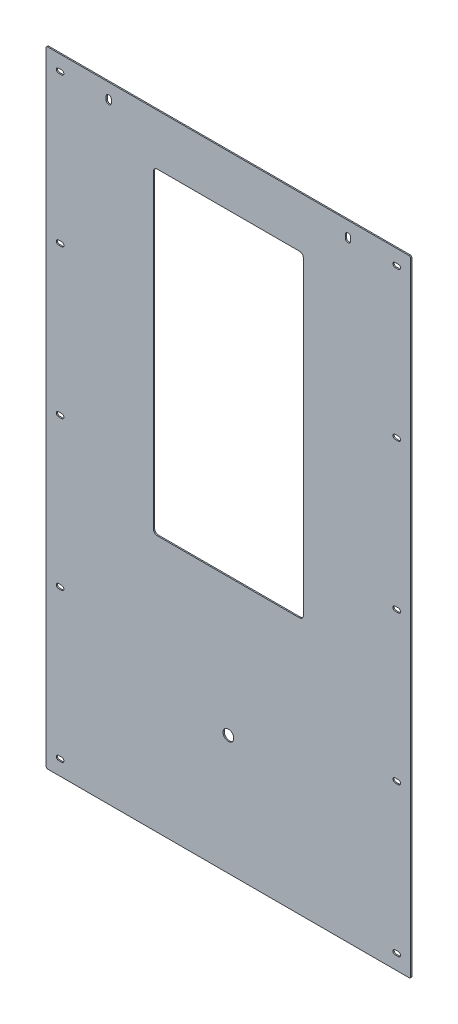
ISO-10303-21;
HEADER;
FILE_DESCRIPTION(('STEP AP214'),'2;1');
FILE_NAME('part.step','',(''),(''),'','','');
FILE_SCHEMA(('AUTOMOTIVE_DESIGN { 1 0 10303 214 1 1 1 1 }'));
ENDSEC;
DATA;
#1=APPLICATION_CONTEXT('core data for automotive mechanical design processes');
#2=APPLICATION_PROTOCOL_DEFINITION('international standard','automotive_design',2000,#1);
#3=PRODUCT_CONTEXT('',#1,'mechanical');
#4=PRODUCT('Part','Part','',(#3));
#5=PRODUCT_RELATED_PRODUCT_CATEGORY('part','',(#4));
#6=PRODUCT_DEFINITION_FORMATION('','',#4);
#7=PRODUCT_DEFINITION_CONTEXT('part definition',#1,'design');
#8=PRODUCT_DEFINITION('design','',#6,#7);
#9=PRODUCT_DEFINITION_SHAPE('','',#8);
#10=(LENGTH_UNIT() NAMED_UNIT(*) SI_UNIT(.MILLI.,.METRE.));
#11=(NAMED_UNIT(*) PLANE_ANGLE_UNIT() SI_UNIT($,.RADIAN.));
#12=(NAMED_UNIT(*) SI_UNIT($,.STERADIAN.) SOLID_ANGLE_UNIT());
#13=UNCERTAINTY_MEASURE_WITH_UNIT(LENGTH_MEASURE(1.E-05),#10,'distance_accuracy_value','');
#14=(GEOMETRIC_REPRESENTATION_CONTEXT(3) GLOBAL_UNCERTAINTY_ASSIGNED_CONTEXT((#13)) GLOBAL_UNIT_ASSIGNED_CONTEXT((#10,
#11,#12)) REPRESENTATION_CONTEXT('',''));
#15=CARTESIAN_POINT('',(0.,0.,0.));
#16=DIRECTION('',(0.,0.,1.));
#17=DIRECTION('',(1.,0.,0.));
#18=AXIS2_PLACEMENT_3D('',#15,#16,#17);
#19=CARTESIAN_POINT('',(228.5,-392.,1.49999999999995));
#20=DIRECTION('',(-1.,0.,0.));
#21=DIRECTION('',(0.,0.,1.));
#22=AXIS2_PLACEMENT_3D('',#19,#20,#21);
#23=PLANE('',#22);
#24=DIRECTION('',(0.,1.,0.));
#25=VECTOR('',#24,1.);
#26=CARTESIAN_POINT('',(228.5,-392.,1.49999999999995));
#27=LINE('',#26,#25);
#28=CARTESIAN_POINT('',(228.5,-390.,1.49999999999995));
#29=VERTEX_POINT('',#28);
#30=CARTESIAN_POINT('',(228.5,390.,1.49999999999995));
#31=VERTEX_POINT('',#30);
#32=EDGE_CURVE('E901',#29,#31,#27,.T.);
#33=ORIENTED_EDGE('',*,*,#32,.F.);
#34=DIRECTION('',(0.,0.,-1.));
#35=VECTOR('',#34,1.);
#36=CARTESIAN_POINT('',(228.5,-390.,1.49999999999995));
#37=LINE('',#36,#35);
#38=CARTESIAN_POINT('',(228.5,-390.,0.));
#39=VERTEX_POINT('',#38);
#40=EDGE_CURVE('E926',#29,#39,#37,.T.);
#41=ORIENTED_EDGE('',*,*,#40,.T.);
#42=DIRECTION('',(0.,1.,0.));
#43=VECTOR('',#42,1.);
#44=CARTESIAN_POINT('',(228.5,-392.,0.));
#45=LINE('',#44,#43);
#46=CARTESIAN_POINT('',(228.5,390.,0.));
#47=VERTEX_POINT('',#46);
#48=EDGE_CURVE('E886',#39,#47,#45,.T.);
#49=ORIENTED_EDGE('',*,*,#48,.T.);
#50=DIRECTION('',(0.,0.,-1.));
#51=VECTOR('',#50,1.);
#52=CARTESIAN_POINT('',(228.5,390.,1.49999999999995));
#53=LINE('',#52,#51);
#54=EDGE_CURVE('E914',#47,#31,#53,.F.);
#55=ORIENTED_EDGE('',*,*,#54,.T.);
#56=EDGE_LOOP('',(#33,#41,#49,#55));
#57=FACE_BOUND('',#56,.T.);
#58=ADVANCED_FACE('F32',(#57),#23,.F.);
#59=CARTESIAN_POINT('',(-228.5,392.,1.49999999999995));
#60=DIRECTION('',(0.,-1.,0.));
#61=DIRECTION('',(0.,0.,-1.));
#62=AXIS2_PLACEMENT_3D('',#59,#60,#61);
#63=PLANE('',#62);
#64=DIRECTION('',(-1.,0.,0.));
#65=VECTOR('',#64,1.);
#66=CARTESIAN_POINT('',(-228.5,392.,0.));
#67=LINE('',#66,#65);
#68=CARTESIAN_POINT('',(226.5,392.,0.));
#69=VERTEX_POINT('',#68);
#70=CARTESIAN_POINT('',(-226.5,392.,0.));
#71=VERTEX_POINT('',#70);
#72=EDGE_CURVE('E917',#69,#71,#67,.T.);
#73=ORIENTED_EDGE('',*,*,#72,.T.);
#74=DIRECTION('',(0.,0.,-1.));
#75=VECTOR('',#74,1.);
#76=CARTESIAN_POINT('',(-226.5,392.,1.49999999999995));
#77=LINE('',#76,#75);
#78=CARTESIAN_POINT('',(-226.5,392.,1.49999999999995));
#79=VERTEX_POINT('',#78);
#80=EDGE_CURVE('E11',#71,#79,#77,.F.);
#81=ORIENTED_EDGE('',*,*,#80,.T.);
#82=DIRECTION('',(-1.,0.,0.));
#83=VECTOR('',#82,1.);
#84=CARTESIAN_POINT('',(-228.5,392.,1.49999999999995));
#85=LINE('',#84,#83);
#86=CARTESIAN_POINT('',(226.5,392.,1.49999999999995));
#87=VERTEX_POINT('',#86);
#88=EDGE_CURVE('E904',#87,#79,#85,.T.);
#89=ORIENTED_EDGE('',*,*,#88,.F.);
#90=DIRECTION('',(0.,0.,-1.));
#91=VECTOR('',#90,1.);
#92=CARTESIAN_POINT('',(226.5,392.,1.49999999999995));
#93=LINE('',#92,#91);
#94=EDGE_CURVE('E41',#87,#69,#93,.T.);
#95=ORIENTED_EDGE('',*,*,#94,.T.);
#96=EDGE_LOOP('',(#73,#81,#89,#95));
#97=FACE_BOUND('',#96,.T.);
#98=ADVANCED_FACE('F960',(#97),#63,.F.);
#99=CARTESIAN_POINT('',(-228.5,-392.,1.49999999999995));
#100=DIRECTION('',(1.,0.,0.));
#101=DIRECTION('',(0.,0.,-1.));
#102=AXIS2_PLACEMENT_3D('',#99,#100,#101);
#103=PLANE('',#102);
#104=DIRECTION('',(0.,-1.,0.));
#105=VECTOR('',#104,1.);
#106=CARTESIAN_POINT('',(-228.5,-392.,0.));
#107=LINE('',#106,#105);
#108=CARTESIAN_POINT('',(-228.5,390.,0.));
#109=VERTEX_POINT('',#108);
#110=CARTESIAN_POINT('',(-228.5,-390.,0.));
#111=VERTEX_POINT('',#110);
#112=EDGE_CURVE('E920',#109,#111,#107,.T.);
#113=ORIENTED_EDGE('',*,*,#112,.T.);
#114=DIRECTION('',(0.,0.,-1.));
#115=VECTOR('',#114,1.);
#116=CARTESIAN_POINT('',(-228.5,-390.,1.49999999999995));
#117=LINE('',#116,#115);
#118=CARTESIAN_POINT('',(-228.5,-390.,1.49999999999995));
#119=VERTEX_POINT('',#118);
#120=EDGE_CURVE('E953',#111,#119,#117,.F.);
#121=ORIENTED_EDGE('',*,*,#120,.T.);
#122=DIRECTION('',(0.,-1.,0.));
#123=VECTOR('',#122,1.);
#124=CARTESIAN_POINT('',(-228.5,-392.,1.49999999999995));
#125=LINE('',#124,#123);
#126=CARTESIAN_POINT('',(-228.5,390.,1.49999999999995));
#127=VERTEX_POINT('',#126);
#128=EDGE_CURVE('E908',#127,#119,#125,.T.);
#129=ORIENTED_EDGE('',*,*,#128,.F.);
#130=DIRECTION('',(0.,0.,-1.));
#131=VECTOR('',#130,1.);
#132=CARTESIAN_POINT('',(-228.5,390.,1.49999999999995));
#133=LINE('',#132,#131);
#134=EDGE_CURVE('E950',#127,#109,#133,.T.);
#135=ORIENTED_EDGE('',*,*,#134,.T.);
#136=EDGE_LOOP('',(#113,#121,#129,#135));
#137=FACE_BOUND('',#136,.T.);
#138=ADVANCED_FACE('F973',(#137),#103,.F.);
#139=CARTESIAN_POINT('',(-228.5,-392.,1.49999999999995));
#140=DIRECTION('',(0.,1.,0.));
#141=DIRECTION('',(0.,0.,1.));
#142=AXIS2_PLACEMENT_3D('',#139,#140,#141);
#143=PLANE('',#142);
#144=DIRECTION('',(1.,0.,0.));
#145=VECTOR('',#144,1.);
#146=CARTESIAN_POINT('',(-228.5,-392.,0.));
#147=LINE('',#146,#145);
#148=CARTESIAN_POINT('',(-226.5,-392.,0.));
#149=VERTEX_POINT('',#148);
#150=CARTESIAN_POINT('',(226.5,-392.,0.));
#151=VERTEX_POINT('',#150);
#152=EDGE_CURVE('E905',#149,#151,#147,.T.);
#153=ORIENTED_EDGE('',*,*,#152,.T.);
#154=DIRECTION('',(0.,0.,-1.));
#155=VECTOR('',#154,1.);
#156=CARTESIAN_POINT('',(226.5,-392.,1.49999999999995));
#157=LINE('',#156,#155);
#158=CARTESIAN_POINT('',(226.5,-392.,1.49999999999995));
#159=VERTEX_POINT('',#158);
#160=EDGE_CURVE('E940',#151,#159,#157,.F.);
#161=ORIENTED_EDGE('',*,*,#160,.T.);
#162=DIRECTION('',(1.,0.,0.));
#163=VECTOR('',#162,1.);
#164=CARTESIAN_POINT('',(-228.5,-392.,1.49999999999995));
#165=LINE('',#164,#163);
#166=CARTESIAN_POINT('',(-226.5,-392.,1.49999999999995));
#167=VERTEX_POINT('',#166);
#168=EDGE_CURVE('E911',#167,#159,#165,.T.);
#169=ORIENTED_EDGE('',*,*,#168,.F.);
#170=DIRECTION('',(0.,0.,-1.));
#171=VECTOR('',#170,1.);
#172=CARTESIAN_POINT('',(-226.5,-392.,1.49999999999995));
#173=LINE('',#172,#171);
#174=EDGE_CURVE('E937',#167,#149,#173,.T.);
#175=ORIENTED_EDGE('',*,*,#174,.T.);
#176=EDGE_LOOP('',(#153,#161,#169,#175));
#177=FACE_BOUND('',#176,.T.);
#178=ADVANCED_FACE('F984',(#177),#143,.F.);
#179=CARTESIAN_POINT('',(0.,0.,1.49999999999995));
#180=DIRECTION('',(0.,0.,-1.));
#181=DIRECTION('',(-1.,0.,0.));
#182=AXIS2_PLACEMENT_3D('',#179,#180,#181);
#183=PLANE('',#182);
#184=CARTESIAN_POINT('',(0.,-242.,1.49999999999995));
#185=DIRECTION('',(0.,0.,1.));
#186=DIRECTION('',(1.,0.,0.));
#187=AXIS2_PLACEMENT_3D('',#184,#185,#186);
#188=CIRCLE('',#187,6.70000000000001);
#189=CARTESIAN_POINT('',(6.70000000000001,-242.,1.49999999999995));
#190=VERTEX_POINT('',#189);
#191=EDGE_CURVE('E461',#190,#190,#188,.T.);
#192=ORIENTED_EDGE('',*,*,#191,.F.);
#193=EDGE_LOOP('',(#192));
#194=FACE_BOUND('',#193,.T.);
#195=DIRECTION('',(0.,1.,0.));
#196=VECTOR('',#195,1.);
#197=CARTESIAN_POINT('',(-146.7,371.,1.49999999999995));
#198=LINE('',#197,#196);
#199=CARTESIAN_POINT('',(-146.7,371.,1.49999999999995));
#200=VERTEX_POINT('',#199);
#201=CARTESIAN_POINT('',(-146.7,375.,1.49999999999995));
#202=VERTEX_POINT('',#201);
#203=EDGE_CURVE('E491',#200,#202,#198,.T.);
#204=ORIENTED_EDGE('',*,*,#203,.F.);
#205=CARTESIAN_POINT('',(-150.,371.,1.49999999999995));
#206=DIRECTION('',(0.,0.,1.));
#207=DIRECTION('',(1.,0.,0.));
#208=AXIS2_PLACEMENT_3D('',#205,#206,#207);
#209=CIRCLE('',#208,3.3);
#210=CARTESIAN_POINT('',(-153.3,371.,1.49999999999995));
#211=VERTEX_POINT('',#210);
#212=EDGE_CURVE('E56',#211,#200,#209,.T.);
#213=ORIENTED_EDGE('',*,*,#212,.F.);
#214=DIRECTION('',(0.,-1.,0.));
#215=VECTOR('',#214,1.);
#216=CARTESIAN_POINT('',(-153.3,371.,1.49999999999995));
#217=LINE('',#216,#215);
#218=CARTESIAN_POINT('',(-153.3,375.,1.49999999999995));
#219=VERTEX_POINT('',#218);
#220=EDGE_CURVE('E480',#219,#211,#217,.T.);
#221=ORIENTED_EDGE('',*,*,#220,.F.);
#222=CARTESIAN_POINT('',(-150.,375.,1.49999999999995));
#223=DIRECTION('',(0.,0.,1.));
#224=DIRECTION('',(1.,0.,0.));
#225=AXIS2_PLACEMENT_3D('',#222,#223,#224);
#226=CIRCLE('',#225,3.3);
#227=EDGE_CURVE('E493',#202,#219,#226,.T.);
#228=ORIENTED_EDGE('',*,*,#227,.F.);
#229=EDGE_LOOP('',(#204,#213,#221,#228));
#230=FACE_BOUND('',#229,.T.);
#231=DIRECTION('',(0.,1.,0.));
#232=VECTOR('',#231,1.);
#233=CARTESIAN_POINT('',(153.3,371.,1.49999999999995));
#234=LINE('',#233,#232);
#235=CARTESIAN_POINT('',(153.3,371.,1.49999999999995));
#236=VERTEX_POINT('',#235);
#237=CARTESIAN_POINT('',(153.3,375.,1.49999999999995));
#238=VERTEX_POINT('',#237);
#239=EDGE_CURVE('E466',#236,#238,#234,.T.);
#240=ORIENTED_EDGE('',*,*,#239,.F.);
#241=CARTESIAN_POINT('',(150.,371.,1.49999999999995));
#242=DIRECTION('',(0.,0.,1.));
#243=DIRECTION('',(1.,0.,0.));
#244=AXIS2_PLACEMENT_3D('',#241,#242,#243);
#245=CIRCLE('',#244,3.29999999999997);
#246=CARTESIAN_POINT('',(146.7,371.,1.49999999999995));
#247=VERTEX_POINT('',#246);
#248=EDGE_CURVE('E48',#247,#236,#245,.T.);
#249=ORIENTED_EDGE('',*,*,#248,.F.);
#250=DIRECTION('',(0.,-1.,0.));
#251=VECTOR('',#250,1.);
#252=CARTESIAN_POINT('',(146.7,371.,1.49999999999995));
#253=LINE('',#252,#251);
#254=CARTESIAN_POINT('',(146.7,375.,1.49999999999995));
#255=VERTEX_POINT('',#254);
#256=EDGE_CURVE('E456',#255,#247,#253,.T.);
#257=ORIENTED_EDGE('',*,*,#256,.F.);
#258=CARTESIAN_POINT('',(150.,375.,1.49999999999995));
#259=DIRECTION('',(0.,0.,1.));
#260=DIRECTION('',(1.,0.,0.));
#261=AXIS2_PLACEMENT_3D('',#258,#259,#260);
#262=CIRCLE('',#261,3.29999999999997);
#263=EDGE_CURVE('E458',#238,#255,#262,.T.);
#264=ORIENTED_EDGE('',*,*,#263,.F.);
#265=EDGE_LOOP('',(#240,#249,#257,#264));
#266=FACE_BOUND('',#265,.T.);
#267=DIRECTION('',(1.,0.,0.));
#268=VECTOR('',#267,1.);
#269=CARTESIAN_POINT('',(-213.,370.25,1.49999999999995));
#270=LINE('',#269,#268);
#271=CARTESIAN_POINT('',(-213.,370.25,1.49999999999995));
#272=VERTEX_POINT('',#271);
#273=CARTESIAN_POINT('',(-209.,370.25,1.49999999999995));
#274=VERTEX_POINT('',#273);
#275=EDGE_CURVE('E658',#272,#274,#270,.T.);
#276=ORIENTED_EDGE('',*,*,#275,.F.);
#277=CARTESIAN_POINT('',(-213.,373.,1.49999999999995));
#278=DIRECTION('',(0.,0.,1.));
#279=DIRECTION('',(-1.,0.,0.));
#280=AXIS2_PLACEMENT_3D('',#277,#278,#279);
#281=CIRCLE('',#280,2.74999999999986);
#282=CARTESIAN_POINT('',(-213.,375.75,1.49999999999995));
#283=VERTEX_POINT('',#282);
#284=EDGE_CURVE('E655',#283,#272,#281,.T.);
#285=ORIENTED_EDGE('',*,*,#284,.F.);
#286=DIRECTION('',(-1.,0.,0.));
#287=VECTOR('',#286,1.);
#288=CARTESIAN_POINT('',(-213.,375.75,1.49999999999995));
#289=LINE('',#288,#287);
#290=CARTESIAN_POINT('',(-209.,375.75,1.49999999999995));
#291=VERTEX_POINT('',#290);
#292=EDGE_CURVE('E645',#291,#283,#289,.T.);
#293=ORIENTED_EDGE('',*,*,#292,.F.);
#294=CARTESIAN_POINT('',(-209.,373.,1.49999999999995));
#295=DIRECTION('',(0.,0.,1.));
#296=DIRECTION('',(-1.,0.,0.));
#297=AXIS2_PLACEMENT_3D('',#294,#295,#296);
#298=CIRCLE('',#297,2.74999999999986);
#299=EDGE_CURVE('E661',#274,#291,#298,.T.);
#300=ORIENTED_EDGE('',*,*,#299,.F.);
#301=EDGE_LOOP('',(#276,#285,#293,#300));
#302=FACE_BOUND('',#301,.T.);
#303=DIRECTION('',(1.,0.,0.));
#304=VECTOR('',#303,1.);
#305=CARTESIAN_POINT('',(-213.,-2.75000000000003,1.49999999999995));
#306=LINE('',#305,#304);
#307=CARTESIAN_POINT('',(-213.,-2.75000000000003,1.49999999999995));
#308=VERTEX_POINT('',#307);
#309=CARTESIAN_POINT('',(-209.,-2.75000000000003,1.49999999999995));
#310=VERTEX_POINT('',#309);
#311=EDGE_CURVE('E724',#308,#310,#306,.T.);
#312=ORIENTED_EDGE('',*,*,#311,.F.);
#313=CARTESIAN_POINT('',(-213.,0.,1.49999999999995));
#314=DIRECTION('',(0.,0.,1.));
#315=DIRECTION('',(-1.,0.,0.));
#316=AXIS2_PLACEMENT_3D('',#313,#314,#315);
#317=CIRCLE('',#316,2.75000000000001);
#318=CARTESIAN_POINT('',(-213.,2.75000000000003,1.49999999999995));
#319=VERTEX_POINT('',#318);
#320=EDGE_CURVE('E721',#319,#308,#317,.T.);
#321=ORIENTED_EDGE('',*,*,#320,.F.);
#322=DIRECTION('',(-1.,0.,0.));
#323=VECTOR('',#322,1.);
#324=CARTESIAN_POINT('',(-213.,2.75000000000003,1.49999999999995));
#325=LINE('',#324,#323);
#326=CARTESIAN_POINT('',(-209.,2.75000000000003,1.49999999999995));
#327=VERTEX_POINT('',#326);
#328=EDGE_CURVE('E711',#327,#319,#325,.T.);
#329=ORIENTED_EDGE('',*,*,#328,.F.);
#330=CARTESIAN_POINT('',(-209.,0.,1.49999999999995));
#331=DIRECTION('',(0.,0.,1.));
#332=DIRECTION('',(-1.,0.,0.));
#333=AXIS2_PLACEMENT_3D('',#330,#331,#332);
#334=CIRCLE('',#333,2.75000000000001);
#335=EDGE_CURVE('E727',#310,#327,#334,.T.);
#336=ORIENTED_EDGE('',*,*,#335,.F.);
#337=EDGE_LOOP('',(#312,#321,#329,#336));
#338=FACE_BOUND('',#337,.T.);
#339=DIRECTION('',(1.,0.,0.));
#340=VECTOR('',#339,1.);
#341=CARTESIAN_POINT('',(-213.,-375.75,1.49999999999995));
#342=LINE('',#341,#340);
#343=CARTESIAN_POINT('',(-213.,-375.75,1.49999999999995));
#344=VERTEX_POINT('',#343);
#345=CARTESIAN_POINT('',(-209.,-375.75,1.49999999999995));
#346=VERTEX_POINT('',#345);
#347=EDGE_CURVE('E789',#344,#346,#342,.T.);
#348=ORIENTED_EDGE('',*,*,#347,.F.);
#349=CARTESIAN_POINT('',(-213.,-373.,1.49999999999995));
#350=DIRECTION('',(0.,0.,1.));
#351=DIRECTION('',(-1.,0.,0.));
#352=AXIS2_PLACEMENT_3D('',#349,#350,#351);
#353=CIRCLE('',#352,2.74999999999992);
#354=CARTESIAN_POINT('',(-213.,-370.25,1.49999999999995));
#355=VERTEX_POINT('',#354);
#356=EDGE_CURVE('E499',#355,#344,#353,.T.);
#357=ORIENTED_EDGE('',*,*,#356,.F.);
#358=DIRECTION('',(-1.,0.,0.));
#359=VECTOR('',#358,1.);
#360=CARTESIAN_POINT('',(-213.,-370.25,1.49999999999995));
#361=LINE('',#360,#359);
#362=CARTESIAN_POINT('',(-209.,-370.25,1.49999999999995));
#363=VERTEX_POINT('',#362);
#364=EDGE_CURVE('E777',#363,#355,#361,.T.);
#365=ORIENTED_EDGE('',*,*,#364,.F.);
#366=CARTESIAN_POINT('',(-209.,-373.,1.49999999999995));
#367=DIRECTION('',(0.,0.,1.));
#368=DIRECTION('',(-1.,0.,0.));
#369=AXIS2_PLACEMENT_3D('',#366,#367,#368);
#370=CIRCLE('',#369,2.74999999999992);
#371=EDGE_CURVE('E791',#346,#363,#370,.T.);
#372=ORIENTED_EDGE('',*,*,#371,.F.);
#373=EDGE_LOOP('',(#348,#357,#365,#372));
#374=FACE_BOUND('',#373,.T.);
#375=DIRECTION('',(-1.,0.,0.));
#376=VECTOR('',#375,1.);
#377=CARTESIAN_POINT('',(213.,-370.25,1.49999999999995));
#378=LINE('',#377,#376);
#379=CARTESIAN_POINT('',(213.,-370.25,1.49999999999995));
#380=VERTEX_POINT('',#379);
#381=CARTESIAN_POINT('',(209.,-370.25,1.49999999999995));
#382=VERTEX_POINT('',#381);
#383=EDGE_CURVE('E625',#380,#382,#378,.T.);
#384=ORIENTED_EDGE('',*,*,#383,.F.);
#385=CARTESIAN_POINT('',(213.,-373.,1.49999999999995));
#386=DIRECTION('',(0.,0.,1.));
#387=DIRECTION('',(1.,0.,0.));
#388=AXIS2_PLACEMENT_3D('',#385,#386,#387);
#389=CIRCLE('',#388,2.74999999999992);
#390=CARTESIAN_POINT('',(213.,-375.75,1.49999999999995));
#391=VERTEX_POINT('',#390);
#392=EDGE_CURVE('E622',#391,#380,#389,.T.);
#393=ORIENTED_EDGE('',*,*,#392,.F.);
#394=DIRECTION('',(1.,0.,0.));
#395=VECTOR('',#394,1.);
#396=CARTESIAN_POINT('',(213.,-375.75,1.49999999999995));
#397=LINE('',#396,#395);
#398=CARTESIAN_POINT('',(209.,-375.75,1.49999999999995));
#399=VERTEX_POINT('',#398);
#400=EDGE_CURVE('E612',#399,#391,#397,.T.);
#401=ORIENTED_EDGE('',*,*,#400,.F.);
#402=CARTESIAN_POINT('',(209.,-373.,1.49999999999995));
#403=DIRECTION('',(0.,0.,1.));
#404=DIRECTION('',(1.,0.,0.));
#405=AXIS2_PLACEMENT_3D('',#402,#403,#404);
#406=CIRCLE('',#405,2.74999999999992);
#407=EDGE_CURVE('E628',#382,#399,#406,.T.);
#408=ORIENTED_EDGE('',*,*,#407,.F.);
#409=EDGE_LOOP('',(#384,#393,#401,#408));
#410=FACE_BOUND('',#409,.T.);
#411=DIRECTION('',(-1.,0.,0.));
#412=VECTOR('',#411,1.);
#413=CARTESIAN_POINT('',(213.,2.75000000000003,1.49999999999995));
#414=LINE('',#413,#412);
#415=CARTESIAN_POINT('',(213.,2.75000000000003,1.49999999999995));
#416=VERTEX_POINT('',#415);
#417=CARTESIAN_POINT('',(209.,2.75000000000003,1.49999999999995));
#418=VERTEX_POINT('',#417);
#419=EDGE_CURVE('E559',#416,#418,#414,.T.);
#420=ORIENTED_EDGE('',*,*,#419,.F.);
#421=CARTESIAN_POINT('',(213.,0.,1.49999999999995));
#422=DIRECTION('',(0.,0.,1.));
#423=DIRECTION('',(1.,0.,0.));
#424=AXIS2_PLACEMENT_3D('',#421,#422,#423);
#425=CIRCLE('',#424,2.75000000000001);
#426=CARTESIAN_POINT('',(213.,-2.75000000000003,1.49999999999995));
#427=VERTEX_POINT('',#426);
#428=EDGE_CURVE('E556',#427,#416,#425,.T.);
#429=ORIENTED_EDGE('',*,*,#428,.F.);
#430=DIRECTION('',(1.,0.,0.));
#431=VECTOR('',#430,1.);
#432=CARTESIAN_POINT('',(213.,-2.75000000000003,1.49999999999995));
#433=LINE('',#432,#431);
#434=CARTESIAN_POINT('',(209.,-2.75000000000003,1.49999999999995));
#435=VERTEX_POINT('',#434);
#436=EDGE_CURVE('E546',#435,#427,#433,.T.);
#437=ORIENTED_EDGE('',*,*,#436,.F.);
#438=CARTESIAN_POINT('',(209.,0.,1.49999999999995));
#439=DIRECTION('',(0.,0.,1.));
#440=DIRECTION('',(1.,0.,0.));
#441=AXIS2_PLACEMENT_3D('',#438,#439,#440);
#442=CIRCLE('',#441,2.75000000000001);
#443=EDGE_CURVE('E562',#418,#435,#442,.T.);
#444=ORIENTED_EDGE('',*,*,#443,.F.);
#445=EDGE_LOOP('',(#420,#429,#437,#444));
#446=FACE_BOUND('',#445,.T.);
#447=DIRECTION('',(-1.,0.,0.));
#448=VECTOR('',#447,1.);
#449=CARTESIAN_POINT('',(213.,375.75,1.49999999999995));
#450=LINE('',#449,#448);
#451=CARTESIAN_POINT('',(213.,375.75,1.49999999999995));
#452=VERTEX_POINT('',#451);
#453=CARTESIAN_POINT('',(209.,375.75,1.49999999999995));
#454=VERTEX_POINT('',#453);
#455=EDGE_CURVE('E820',#452,#454,#450,.T.);
#456=ORIENTED_EDGE('',*,*,#455,.F.);
#457=CARTESIAN_POINT('',(213.,373.,1.49999999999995));
#458=DIRECTION('',(0.,0.,1.));
#459=DIRECTION('',(1.,0.,0.));
#460=AXIS2_PLACEMENT_3D('',#457,#458,#459);
#461=CIRCLE('',#460,2.74999999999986);
#462=CARTESIAN_POINT('',(213.,370.25,1.49999999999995));
#463=VERTEX_POINT('',#462);
#464=EDGE_CURVE('E534',#463,#452,#461,.T.);
#465=ORIENTED_EDGE('',*,*,#464,.F.);
#466=DIRECTION('',(1.,0.,0.));
#467=VECTOR('',#466,1.);
#468=CARTESIAN_POINT('',(213.,370.25,1.49999999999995));
#469=LINE('',#468,#467);
#470=CARTESIAN_POINT('',(209.,370.25,1.49999999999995));
#471=VERTEX_POINT('',#470);
#472=EDGE_CURVE('E808',#471,#463,#469,.T.);
#473=ORIENTED_EDGE('',*,*,#472,.F.);
#474=CARTESIAN_POINT('',(209.,373.,1.49999999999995));
#475=DIRECTION('',(0.,0.,1.));
#476=DIRECTION('',(1.,0.,0.));
#477=AXIS2_PLACEMENT_3D('',#474,#475,#476);
#478=CIRCLE('',#477,2.74999999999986);
#479=EDGE_CURVE('E822',#454,#471,#478,.T.);
#480=ORIENTED_EDGE('',*,*,#479,.F.);
#481=EDGE_LOOP('',(#456,#465,#473,#480));
#482=FACE_BOUND('',#481,.T.);
#483=DIRECTION('',(-1.,0.,0.));
#484=VECTOR('',#483,1.);
#485=CARTESIAN_POINT('',(213.,189.25,1.49999999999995));
#486=LINE('',#485,#484);
#487=CARTESIAN_POINT('',(213.,189.25,1.49999999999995));
#488=VERTEX_POINT('',#487);
#489=CARTESIAN_POINT('',(209.,189.25,1.49999999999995));
#490=VERTEX_POINT('',#489);
#491=EDGE_CURVE('E524',#488,#490,#486,.T.);
#492=ORIENTED_EDGE('',*,*,#491,.F.);
#493=CARTESIAN_POINT('',(213.,186.5,1.49999999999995));
#494=DIRECTION('',(0.,0.,1.));
#495=DIRECTION('',(1.,0.,0.));
#496=AXIS2_PLACEMENT_3D('',#493,#494,#495);
#497=CIRCLE('',#496,2.74999999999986);
#498=CARTESIAN_POINT('',(213.,183.75,1.49999999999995));
#499=VERTEX_POINT('',#498);
#500=EDGE_CURVE('E521',#499,#488,#497,.T.);
#501=ORIENTED_EDGE('',*,*,#500,.F.);
#502=DIRECTION('',(1.,0.,0.));
#503=VECTOR('',#502,1.);
#504=CARTESIAN_POINT('',(213.,183.75,1.49999999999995));
#505=LINE('',#504,#503);
#506=CARTESIAN_POINT('',(209.,183.75,1.49999999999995));
#507=VERTEX_POINT('',#506);
#508=EDGE_CURVE('E511',#507,#499,#505,.T.);
#509=ORIENTED_EDGE('',*,*,#508,.F.);
#510=CARTESIAN_POINT('',(209.,186.5,1.49999999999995));
#511=DIRECTION('',(0.,0.,1.));
#512=DIRECTION('',(1.,0.,0.));
#513=AXIS2_PLACEMENT_3D('',#510,#511,#512);
#514=CIRCLE('',#513,2.74999999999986);
#515=EDGE_CURVE('E527',#490,#507,#514,.T.);
#516=ORIENTED_EDGE('',*,*,#515,.F.);
#517=EDGE_LOOP('',(#492,#501,#509,#516));
#518=FACE_BOUND('',#517,.T.);
#519=DIRECTION('',(-1.,0.,0.));
#520=VECTOR('',#519,1.);
#521=CARTESIAN_POINT('',(213.,-183.75,1.49999999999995));
#522=LINE('',#521,#520);
#523=CARTESIAN_POINT('',(213.,-183.75,1.49999999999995));
#524=VERTEX_POINT('',#523);
#525=CARTESIAN_POINT('',(209.,-183.75,1.49999999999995));
#526=VERTEX_POINT('',#525);
#527=EDGE_CURVE('E592',#524,#526,#522,.T.);
#528=ORIENTED_EDGE('',*,*,#527,.F.);
#529=CARTESIAN_POINT('',(213.,-186.5,1.49999999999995));
#530=DIRECTION('',(0.,0.,1.));
#531=DIRECTION('',(1.,0.,0.));
#532=AXIS2_PLACEMENT_3D('',#529,#530,#531);
#533=CIRCLE('',#532,2.74999999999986);
#534=CARTESIAN_POINT('',(213.,-189.25,1.49999999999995));
#535=VERTEX_POINT('',#534);
#536=EDGE_CURVE('E589',#535,#524,#533,.T.);
#537=ORIENTED_EDGE('',*,*,#536,.F.);
#538=DIRECTION('',(1.,0.,0.));
#539=VECTOR('',#538,1.);
#540=CARTESIAN_POINT('',(213.,-189.25,1.49999999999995));
#541=LINE('',#540,#539);
#542=CARTESIAN_POINT('',(209.,-189.25,1.49999999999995));
#543=VERTEX_POINT('',#542);
#544=EDGE_CURVE('E579',#543,#535,#541,.T.);
#545=ORIENTED_EDGE('',*,*,#544,.F.);
#546=CARTESIAN_POINT('',(209.,-186.5,1.49999999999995));
#547=DIRECTION('',(0.,0.,1.));
#548=DIRECTION('',(1.,0.,0.));
#549=AXIS2_PLACEMENT_3D('',#546,#547,#548);
#550=CIRCLE('',#549,2.74999999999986);
#551=EDGE_CURVE('E595',#526,#543,#550,.T.);
#552=ORIENTED_EDGE('',*,*,#551,.F.);
#553=EDGE_LOOP('',(#528,#537,#545,#552));
#554=FACE_BOUND('',#553,.T.);
#555=DIRECTION('',(1.,0.,0.));
#556=VECTOR('',#555,1.);
#557=CARTESIAN_POINT('',(-213.,-189.25,1.49999999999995));
#558=LINE('',#557,#556);
#559=CARTESIAN_POINT('',(-213.,-189.25,1.49999999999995));
#560=VERTEX_POINT('',#559);
#561=CARTESIAN_POINT('',(-209.,-189.25,1.49999999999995));
#562=VERTEX_POINT('',#561);
#563=EDGE_CURVE('E757',#560,#562,#558,.T.);
#564=ORIENTED_EDGE('',*,*,#563,.F.);
#565=CARTESIAN_POINT('',(-213.,-186.5,1.49999999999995));
#566=DIRECTION('',(0.,0.,1.));
#567=DIRECTION('',(-1.,0.,0.));
#568=AXIS2_PLACEMENT_3D('',#565,#566,#567);
#569=CIRCLE('',#568,2.74999999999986);
#570=CARTESIAN_POINT('',(-213.,-183.75,1.49999999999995));
#571=VERTEX_POINT('',#570);
#572=EDGE_CURVE('E754',#571,#560,#569,.T.);
#573=ORIENTED_EDGE('',*,*,#572,.F.);
#574=DIRECTION('',(-1.,0.,0.));
#575=VECTOR('',#574,1.);
#576=CARTESIAN_POINT('',(-213.,-183.75,1.49999999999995));
#577=LINE('',#576,#575);
#578=CARTESIAN_POINT('',(-209.,-183.75,1.49999999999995));
#579=VERTEX_POINT('',#578);
#580=EDGE_CURVE('E744',#579,#571,#577,.T.);
#581=ORIENTED_EDGE('',*,*,#580,.F.);
#582=CARTESIAN_POINT('',(-209.,-186.5,1.49999999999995));
#583=DIRECTION('',(0.,0.,1.));
#584=DIRECTION('',(-1.,0.,0.));
#585=AXIS2_PLACEMENT_3D('',#582,#583,#584);
#586=CIRCLE('',#585,2.74999999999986);
#587=EDGE_CURVE('E760',#562,#579,#586,.T.);
#588=ORIENTED_EDGE('',*,*,#587,.F.);
#589=EDGE_LOOP('',(#564,#573,#581,#588));
#590=FACE_BOUND('',#589,.T.);
#591=DIRECTION('',(1.,0.,0.));
#592=VECTOR('',#591,1.);
#593=CARTESIAN_POINT('',(-213.,183.75,1.49999999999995));
#594=LINE('',#593,#592);
#595=CARTESIAN_POINT('',(-213.,183.75,1.49999999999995));
#596=VERTEX_POINT('',#595);
#597=CARTESIAN_POINT('',(-209.,183.75,1.49999999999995));
#598=VERTEX_POINT('',#597);
#599=EDGE_CURVE('E691',#596,#598,#594,.T.);
#600=ORIENTED_EDGE('',*,*,#599,.F.);
#601=CARTESIAN_POINT('',(-213.,186.5,1.49999999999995));
#602=DIRECTION('',(0.,0.,1.));
#603=DIRECTION('',(-1.,0.,0.));
#604=AXIS2_PLACEMENT_3D('',#601,#602,#603);
#605=CIRCLE('',#604,2.74999999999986);
#606=CARTESIAN_POINT('',(-213.,189.25,1.49999999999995));
#607=VERTEX_POINT('',#606);
#608=EDGE_CURVE('E688',#607,#596,#605,.T.);
#609=ORIENTED_EDGE('',*,*,#608,.F.);
#610=DIRECTION('',(-1.,0.,0.));
#611=VECTOR('',#610,1.);
#612=CARTESIAN_POINT('',(-213.,189.25,1.49999999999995));
#613=LINE('',#612,#611);
#614=CARTESIAN_POINT('',(-209.,189.25,1.49999999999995));
#615=VERTEX_POINT('',#614);
#616=EDGE_CURVE('E678',#615,#607,#613,.T.);
#617=ORIENTED_EDGE('',*,*,#616,.F.);
#618=CARTESIAN_POINT('',(-209.,186.5,1.49999999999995));
#619=DIRECTION('',(0.,0.,1.));
#620=DIRECTION('',(-1.,0.,0.));
#621=AXIS2_PLACEMENT_3D('',#618,#619,#620);
#622=CIRCLE('',#621,2.74999999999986);
#623=EDGE_CURVE('E694',#598,#615,#622,.T.);
#624=ORIENTED_EDGE('',*,*,#623,.F.);
#625=EDGE_LOOP('',(#600,#609,#617,#624));
#626=FACE_BOUND('',#625,.T.);
#627=DIRECTION('',(0.,1.,0.));
#628=VECTOR('',#627,1.);
#629=CARTESIAN_POINT('',(94.,-65.,1.49999999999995));
#630=LINE('',#629,#628);
#631=CARTESIAN_POINT('',(94.,-65.,1.49999999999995));
#632=VERTEX_POINT('',#631);
#633=CARTESIAN_POINT('',(94.,323.,1.49999999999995));
#634=VERTEX_POINT('',#633);
#635=EDGE_CURVE('E864',#632,#634,#630,.T.);
#636=ORIENTED_EDGE('',*,*,#635,.F.);
#637=CARTESIAN_POINT('',(89.,-65.,1.49999999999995));
#638=DIRECTION('',(0.,0.,1.));
#639=DIRECTION('',(-1.,0.,0.));
#640=AXIS2_PLACEMENT_3D('',#637,#638,#639);
#641=CIRCLE('',#640,5.);
#642=CARTESIAN_POINT('',(89.,-70.,1.49999999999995));
#643=VERTEX_POINT('',#642);
#644=EDGE_CURVE('E829',#643,#632,#641,.T.);
#645=ORIENTED_EDGE('',*,*,#644,.F.);
#646=DIRECTION('',(1.,0.,0.));
#647=VECTOR('',#646,1.);
#648=CARTESIAN_POINT('',(-89.,-70.,1.49999999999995));
#649=LINE('',#648,#647);
#650=CARTESIAN_POINT('',(-89.,-70.,1.49999999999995));
#651=VERTEX_POINT('',#650);
#652=EDGE_CURVE('E841',#651,#643,#649,.T.);
#653=ORIENTED_EDGE('',*,*,#652,.F.);
#654=CARTESIAN_POINT('',(-89.,-65.,1.49999999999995));
#655=DIRECTION('',(0.,0.,1.));
#656=DIRECTION('',(1.,0.,0.));
#657=AXIS2_PLACEMENT_3D('',#654,#655,#656);
#658=CIRCLE('',#657,5.);
#659=CARTESIAN_POINT('',(-94.,-65.,1.49999999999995));
#660=VERTEX_POINT('',#659);
#661=EDGE_CURVE('E879',#660,#651,#658,.T.);
#662=ORIENTED_EDGE('',*,*,#661,.F.);
#663=DIRECTION('',(0.,-1.,0.));
#664=VECTOR('',#663,1.);
#665=CARTESIAN_POINT('',(-94.,-65.,1.49999999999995));
#666=LINE('',#665,#664);
#667=CARTESIAN_POINT('',(-94.,323.,1.49999999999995));
#668=VERTEX_POINT('',#667);
#669=EDGE_CURVE('E876',#668,#660,#666,.T.);
#670=ORIENTED_EDGE('',*,*,#669,.F.);
#671=CARTESIAN_POINT('',(-89.,323.,1.49999999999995));
#672=DIRECTION('',(0.,0.,1.));
#673=DIRECTION('',(1.,0.,0.));
#674=AXIS2_PLACEMENT_3D('',#671,#672,#673);
#675=CIRCLE('',#674,5.);
#676=CARTESIAN_POINT('',(-89.,328.,1.49999999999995));
#677=VERTEX_POINT('',#676);
#678=EDGE_CURVE('E873',#677,#668,#675,.T.);
#679=ORIENTED_EDGE('',*,*,#678,.F.);
#680=DIRECTION('',(-1.,0.,0.));
#681=VECTOR('',#680,1.);
#682=CARTESIAN_POINT('',(-89.,328.,1.49999999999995));
#683=LINE('',#682,#681);
#684=CARTESIAN_POINT('',(89.,328.,1.49999999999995));
#685=VERTEX_POINT('',#684);
#686=EDGE_CURVE('E870',#685,#677,#683,.T.);
#687=ORIENTED_EDGE('',*,*,#686,.F.);
#688=CARTESIAN_POINT('',(89.,323.,1.49999999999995));
#689=DIRECTION('',(0.,0.,1.));
#690=DIRECTION('',(1.,0.,0.));
#691=AXIS2_PLACEMENT_3D('',#688,#689,#690);
#692=CIRCLE('',#691,5.);
#693=EDGE_CURVE('E867',#634,#685,#692,.T.);
#694=ORIENTED_EDGE('',*,*,#693,.F.);
#695=EDGE_LOOP('',(#636,#645,#653,#662,#670,#679,#687,#694));
#696=FACE_BOUND('',#695,.T.);
#697=ORIENTED_EDGE('',*,*,#168,.T.);
#698=CARTESIAN_POINT('',(226.5,-390.,1.49999999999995));
#699=DIRECTION('',(0.,0.,-1.));
#700=DIRECTION('',(-1.,0.,0.));
#701=AXIS2_PLACEMENT_3D('',#698,#699,#700);
#702=CIRCLE('',#701,2.);
#703=EDGE_CURVE('E948',#159,#29,#702,.F.);
#704=ORIENTED_EDGE('',*,*,#703,.T.);
#705=ORIENTED_EDGE('',*,*,#32,.T.);
#706=CARTESIAN_POINT('',(226.5,390.,1.49999999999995));
#707=DIRECTION('',(0.,0.,-1.));
#708=DIRECTION('',(-1.,0.,0.));
#709=AXIS2_PLACEMENT_3D('',#706,#707,#708);
#710=CIRCLE('',#709,2.);
#711=EDGE_CURVE('E942',#31,#87,#710,.F.);
#712=ORIENTED_EDGE('',*,*,#711,.T.);
#713=ORIENTED_EDGE('',*,*,#88,.T.);
#714=CARTESIAN_POINT('',(-226.5,390.,1.49999999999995));
#715=DIRECTION('',(0.,0.,-1.));
#716=DIRECTION('',(-1.,0.,0.));
#717=AXIS2_PLACEMENT_3D('',#714,#715,#716);
#718=CIRCLE('',#717,2.);
#719=EDGE_CURVE('E944',#79,#127,#718,.F.);
#720=ORIENTED_EDGE('',*,*,#719,.T.);
#721=ORIENTED_EDGE('',*,*,#128,.T.);
#722=CARTESIAN_POINT('',(-226.5,-390.,1.49999999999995));
#723=DIRECTION('',(0.,0.,-1.));
#724=DIRECTION('',(-1.,0.,0.));
#725=AXIS2_PLACEMENT_3D('',#722,#723,#724);
#726=CIRCLE('',#725,2.);
#727=EDGE_CURVE('E946',#119,#167,#726,.F.);
#728=ORIENTED_EDGE('',*,*,#727,.T.);
#729=EDGE_LOOP('',(#697,#704,#705,#712,#713,#720,#721,#728));
#730=FACE_BOUND('',#729,.T.);
#731=ADVANCED_FACE('F977',(#194,#230,#266,#302,#338,#374,#410,#446,#482,#518,#554,#590,#626,
#696,#730),#183,.F.);
#732=CARTESIAN_POINT('',(0.,0.,0.));
#733=DIRECTION('',(0.,0.,-1.));
#734=DIRECTION('',(-1.,0.,0.));
#735=AXIS2_PLACEMENT_3D('',#732,#733,#734);
#736=PLANE('',#735);
#737=CARTESIAN_POINT('',(0.,-242.,0.));
#738=DIRECTION('',(0.,0.,-1.));
#739=DIRECTION('',(-1.,0.,0.));
#740=AXIS2_PLACEMENT_3D('',#737,#738,#739);
#741=CIRCLE('',#740,6.70000000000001);
#742=CARTESIAN_POINT('',(-6.70000000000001,-242.,0.));
#743=VERTEX_POINT('',#742);
#744=EDGE_CURVE('E36',#743,#743,#741,.T.);
#745=ORIENTED_EDGE('',*,*,#744,.F.);
#746=EDGE_LOOP('',(#745));
#747=FACE_BOUND('',#746,.T.);
#748=CARTESIAN_POINT('',(150.,371.,0.));
#749=DIRECTION('',(0.,0.,1.));
#750=DIRECTION('',(1.,0.,0.));
#751=AXIS2_PLACEMENT_3D('',#748,#749,#750);
#752=CIRCLE('',#751,3.29999999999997);
#753=CARTESIAN_POINT('',(146.7,371.,0.));
#754=VERTEX_POINT('',#753);
#755=CARTESIAN_POINT('',(153.3,371.,0.));
#756=VERTEX_POINT('',#755);
#757=EDGE_CURVE('E447',#754,#756,#752,.T.);
#758=ORIENTED_EDGE('',*,*,#757,.T.);
#759=DIRECTION('',(0.,1.,0.));
#760=VECTOR('',#759,1.);
#761=CARTESIAN_POINT('',(153.3,371.,0.));
#762=LINE('',#761,#760);
#763=CARTESIAN_POINT('',(153.3,375.,0.));
#764=VERTEX_POINT('',#763);
#765=EDGE_CURVE('E436',#756,#764,#762,.T.);
#766=ORIENTED_EDGE('',*,*,#765,.T.);
#767=CARTESIAN_POINT('',(150.,375.,0.));
#768=DIRECTION('',(0.,0.,1.));
#769=DIRECTION('',(1.,0.,0.));
#770=AXIS2_PLACEMENT_3D('',#767,#768,#769);
#771=CIRCLE('',#770,3.29999999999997);
#772=CARTESIAN_POINT('',(146.7,375.,0.));
#773=VERTEX_POINT('',#772);
#774=EDGE_CURVE('E446',#764,#773,#771,.T.);
#775=ORIENTED_EDGE('',*,*,#774,.T.);
#776=DIRECTION('',(0.,-1.,0.));
#777=VECTOR('',#776,1.);
#778=CARTESIAN_POINT('',(146.7,371.,0.));
#779=LINE('',#778,#777);
#780=EDGE_CURVE('E452',#773,#754,#779,.T.);
#781=ORIENTED_EDGE('',*,*,#780,.T.);
#782=EDGE_LOOP('',(#758,#766,#775,#781));
#783=FACE_BOUND('',#782,.T.);
#784=CARTESIAN_POINT('',(-150.,371.,0.));
#785=DIRECTION('',(0.,0.,1.));
#786=DIRECTION('',(1.,0.,0.));
#787=AXIS2_PLACEMENT_3D('',#784,#785,#786);
#788=CIRCLE('',#787,3.3);
#789=CARTESIAN_POINT('',(-153.3,371.,0.));
#790=VERTEX_POINT('',#789);
#791=CARTESIAN_POINT('',(-146.7,371.,0.));
#792=VERTEX_POINT('',#791);
#793=EDGE_CURVE('E476',#790,#792,#788,.T.);
#794=ORIENTED_EDGE('',*,*,#793,.T.);
#795=DIRECTION('',(0.,1.,0.));
#796=VECTOR('',#795,1.);
#797=CARTESIAN_POINT('',(-146.7,371.,0.));
#798=LINE('',#797,#796);
#799=CARTESIAN_POINT('',(-146.7,375.,0.));
#800=VERTEX_POINT('',#799);
#801=EDGE_CURVE('E479',#792,#800,#798,.T.);
#802=ORIENTED_EDGE('',*,*,#801,.T.);
#803=CARTESIAN_POINT('',(-150.,375.,0.));
#804=DIRECTION('',(0.,0.,1.));
#805=DIRECTION('',(1.,0.,0.));
#806=AXIS2_PLACEMENT_3D('',#803,#804,#805);
#807=CIRCLE('',#806,3.3);
#808=CARTESIAN_POINT('',(-153.3,375.,0.));
#809=VERTEX_POINT('',#808);
#810=EDGE_CURVE('E483',#800,#809,#807,.T.);
#811=ORIENTED_EDGE('',*,*,#810,.T.);
#812=DIRECTION('',(0.,-1.,0.));
#813=VECTOR('',#812,1.);
#814=CARTESIAN_POINT('',(-153.3,371.,0.));
#815=LINE('',#814,#813);
#816=EDGE_CURVE('E486',#809,#790,#815,.T.);
#817=ORIENTED_EDGE('',*,*,#816,.T.);
#818=EDGE_LOOP('',(#794,#802,#811,#817));
#819=FACE_BOUND('',#818,.T.);
#820=CARTESIAN_POINT('',(213.,186.5,0.));
#821=DIRECTION('',(0.,0.,1.));
#822=DIRECTION('',(1.,0.,0.));
#823=AXIS2_PLACEMENT_3D('',#820,#821,#822);
#824=CIRCLE('',#823,2.74999999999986);
#825=CARTESIAN_POINT('',(213.,183.75,0.));
#826=VERTEX_POINT('',#825);
#827=CARTESIAN_POINT('',(213.,189.25,0.));
#828=VERTEX_POINT('',#827);
#829=EDGE_CURVE('E507',#826,#828,#824,.T.);
#830=ORIENTED_EDGE('',*,*,#829,.T.);
#831=DIRECTION('',(-1.,0.,0.));
#832=VECTOR('',#831,1.);
#833=CARTESIAN_POINT('',(213.,189.25,0.));
#834=LINE('',#833,#832);
#835=CARTESIAN_POINT('',(209.,189.25,0.));
#836=VERTEX_POINT('',#835);
#837=EDGE_CURVE('E510',#828,#836,#834,.T.);
#838=ORIENTED_EDGE('',*,*,#837,.T.);
#839=CARTESIAN_POINT('',(209.,186.5,0.));
#840=DIRECTION('',(0.,0.,1.));
#841=DIRECTION('',(1.,0.,0.));
#842=AXIS2_PLACEMENT_3D('',#839,#840,#841);
#843=CIRCLE('',#842,2.74999999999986);
#844=CARTESIAN_POINT('',(209.,183.75,0.));
#845=VERTEX_POINT('',#844);
#846=EDGE_CURVE('E514',#836,#845,#843,.T.);
#847=ORIENTED_EDGE('',*,*,#846,.T.);
#848=DIRECTION('',(1.,0.,0.));
#849=VECTOR('',#848,1.);
#850=CARTESIAN_POINT('',(213.,183.75,0.));
#851=LINE('',#850,#849);
#852=EDGE_CURVE('E517',#845,#826,#851,.T.);
#853=ORIENTED_EDGE('',*,*,#852,.T.);
#854=EDGE_LOOP('',(#830,#838,#847,#853));
#855=FACE_BOUND('',#854,.T.);
#856=CARTESIAN_POINT('',(213.,0.,0.));
#857=DIRECTION('',(0.,0.,1.));
#858=DIRECTION('',(1.,0.,0.));
#859=AXIS2_PLACEMENT_3D('',#856,#857,#858);
#860=CIRCLE('',#859,2.75000000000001);
#861=CARTESIAN_POINT('',(213.,-2.75000000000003,0.));
#862=VERTEX_POINT('',#861);
#863=CARTESIAN_POINT('',(213.,2.75000000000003,0.));
#864=VERTEX_POINT('',#863);
#865=EDGE_CURVE('E542',#862,#864,#860,.T.);
#866=ORIENTED_EDGE('',*,*,#865,.T.);
#867=DIRECTION('',(-1.,0.,0.));
#868=VECTOR('',#867,1.);
#869=CARTESIAN_POINT('',(213.,2.75000000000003,0.));
#870=LINE('',#869,#868);
#871=CARTESIAN_POINT('',(209.,2.75000000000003,0.));
#872=VERTEX_POINT('',#871);
#873=EDGE_CURVE('E545',#864,#872,#870,.T.);
#874=ORIENTED_EDGE('',*,*,#873,.T.);
#875=CARTESIAN_POINT('',(209.,0.,0.));
#876=DIRECTION('',(0.,0.,1.));
#877=DIRECTION('',(1.,0.,0.));
#878=AXIS2_PLACEMENT_3D('',#875,#876,#877);
#879=CIRCLE('',#878,2.75000000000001);
#880=CARTESIAN_POINT('',(209.,-2.75000000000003,0.));
#881=VERTEX_POINT('',#880);
#882=EDGE_CURVE('E549',#872,#881,#879,.T.);
#883=ORIENTED_EDGE('',*,*,#882,.T.);
#884=DIRECTION('',(1.,0.,0.));
#885=VECTOR('',#884,1.);
#886=CARTESIAN_POINT('',(213.,-2.75000000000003,0.));
#887=LINE('',#886,#885);
#888=EDGE_CURVE('E552',#881,#862,#887,.T.);
#889=ORIENTED_EDGE('',*,*,#888,.T.);
#890=EDGE_LOOP('',(#866,#874,#883,#889));
#891=FACE_BOUND('',#890,.T.);
#892=CARTESIAN_POINT('',(213.,-186.5,0.));
#893=DIRECTION('',(0.,0.,1.));
#894=DIRECTION('',(1.,0.,0.));
#895=AXIS2_PLACEMENT_3D('',#892,#893,#894);
#896=CIRCLE('',#895,2.74999999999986);
#897=CARTESIAN_POINT('',(213.,-189.25,0.));
#898=VERTEX_POINT('',#897);
#899=CARTESIAN_POINT('',(213.,-183.75,0.));
#900=VERTEX_POINT('',#899);
#901=EDGE_CURVE('E575',#898,#900,#896,.T.);
#902=ORIENTED_EDGE('',*,*,#901,.T.);
#903=DIRECTION('',(-1.,0.,0.));
#904=VECTOR('',#903,1.);
#905=CARTESIAN_POINT('',(213.,-183.75,0.));
#906=LINE('',#905,#904);
#907=CARTESIAN_POINT('',(209.,-183.75,0.));
#908=VERTEX_POINT('',#907);
#909=EDGE_CURVE('E578',#900,#908,#906,.T.);
#910=ORIENTED_EDGE('',*,*,#909,.T.);
#911=CARTESIAN_POINT('',(209.,-186.5,0.));
#912=DIRECTION('',(0.,0.,1.));
#913=DIRECTION('',(1.,0.,0.));
#914=AXIS2_PLACEMENT_3D('',#911,#912,#913);
#915=CIRCLE('',#914,2.74999999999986);
#916=CARTESIAN_POINT('',(209.,-189.25,0.));
#917=VERTEX_POINT('',#916);
#918=EDGE_CURVE('E582',#908,#917,#915,.T.);
#919=ORIENTED_EDGE('',*,*,#918,.T.);
#920=DIRECTION('',(1.,0.,0.));
#921=VECTOR('',#920,1.);
#922=CARTESIAN_POINT('',(213.,-189.25,0.));
#923=LINE('',#922,#921);
#924=EDGE_CURVE('E585',#917,#898,#923,.T.);
#925=ORIENTED_EDGE('',*,*,#924,.T.);
#926=EDGE_LOOP('',(#902,#910,#919,#925));
#927=FACE_BOUND('',#926,.T.);
#928=CARTESIAN_POINT('',(213.,-373.,0.));
#929=DIRECTION('',(0.,0.,1.));
#930=DIRECTION('',(1.,0.,0.));
#931=AXIS2_PLACEMENT_3D('',#928,#929,#930);
#932=CIRCLE('',#931,2.74999999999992);
#933=CARTESIAN_POINT('',(213.,-375.75,0.));
#934=VERTEX_POINT('',#933);
#935=CARTESIAN_POINT('',(213.,-370.25,0.));
#936=VERTEX_POINT('',#935);
#937=EDGE_CURVE('E608',#934,#936,#932,.T.);
#938=ORIENTED_EDGE('',*,*,#937,.T.);
#939=DIRECTION('',(-1.,0.,0.));
#940=VECTOR('',#939,1.);
#941=CARTESIAN_POINT('',(213.,-370.25,0.));
#942=LINE('',#941,#940);
#943=CARTESIAN_POINT('',(209.,-370.25,0.));
#944=VERTEX_POINT('',#943);
#945=EDGE_CURVE('E611',#936,#944,#942,.T.);
#946=ORIENTED_EDGE('',*,*,#945,.T.);
#947=CARTESIAN_POINT('',(209.,-373.,0.));
#948=DIRECTION('',(0.,0.,1.));
#949=DIRECTION('',(1.,0.,0.));
#950=AXIS2_PLACEMENT_3D('',#947,#948,#949);
#951=CIRCLE('',#950,2.74999999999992);
#952=CARTESIAN_POINT('',(209.,-375.75,0.));
#953=VERTEX_POINT('',#952);
#954=EDGE_CURVE('E615',#944,#953,#951,.T.);
#955=ORIENTED_EDGE('',*,*,#954,.T.);
#956=DIRECTION('',(1.,0.,0.));
#957=VECTOR('',#956,1.);
#958=CARTESIAN_POINT('',(213.,-375.75,0.));
#959=LINE('',#958,#957);
#960=EDGE_CURVE('E618',#953,#934,#959,.T.);
#961=ORIENTED_EDGE('',*,*,#960,.T.);
#962=EDGE_LOOP('',(#938,#946,#955,#961));
#963=FACE_BOUND('',#962,.T.);
#964=CARTESIAN_POINT('',(-213.,373.,0.));
#965=DIRECTION('',(0.,0.,1.));
#966=DIRECTION('',(-1.,0.,0.));
#967=AXIS2_PLACEMENT_3D('',#964,#965,#966);
#968=CIRCLE('',#967,2.74999999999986);
#969=CARTESIAN_POINT('',(-213.,375.75,0.));
#970=VERTEX_POINT('',#969);
#971=CARTESIAN_POINT('',(-213.,370.25,0.));
#972=VERTEX_POINT('',#971);
#973=EDGE_CURVE('E641',#970,#972,#968,.T.);
#974=ORIENTED_EDGE('',*,*,#973,.T.);
#975=DIRECTION('',(1.,0.,0.));
#976=VECTOR('',#975,1.);
#977=CARTESIAN_POINT('',(-213.,370.25,0.));
#978=LINE('',#977,#976);
#979=CARTESIAN_POINT('',(-209.,370.25,0.));
#980=VERTEX_POINT('',#979);
#981=EDGE_CURVE('E644',#972,#980,#978,.T.);
#982=ORIENTED_EDGE('',*,*,#981,.T.);
#983=CARTESIAN_POINT('',(-209.,373.,0.));
#984=DIRECTION('',(0.,0.,1.));
#985=DIRECTION('',(-1.,0.,0.));
#986=AXIS2_PLACEMENT_3D('',#983,#984,#985);
#987=CIRCLE('',#986,2.74999999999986);
#988=CARTESIAN_POINT('',(-209.,375.75,0.));
#989=VERTEX_POINT('',#988);
#990=EDGE_CURVE('E648',#980,#989,#987,.T.);
#991=ORIENTED_EDGE('',*,*,#990,.T.);
#992=DIRECTION('',(-1.,0.,0.));
#993=VECTOR('',#992,1.);
#994=CARTESIAN_POINT('',(-213.,375.75,0.));
#995=LINE('',#994,#993);
#996=EDGE_CURVE('E651',#989,#970,#995,.T.);
#997=ORIENTED_EDGE('',*,*,#996,.T.);
#998=EDGE_LOOP('',(#974,#982,#991,#997));
#999=FACE_BOUND('',#998,.T.);
#1000=CARTESIAN_POINT('',(-213.,186.5,0.));
#1001=DIRECTION('',(0.,0.,1.));
#1002=DIRECTION('',(-1.,0.,0.));
#1003=AXIS2_PLACEMENT_3D('',#1000,#1001,#1002);
#1004=CIRCLE('',#1003,2.74999999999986);
#1005=CARTESIAN_POINT('',(-213.,189.25,0.));
#1006=VERTEX_POINT('',#1005);
#1007=CARTESIAN_POINT('',(-213.,183.75,0.));
#1008=VERTEX_POINT('',#1007);
#1009=EDGE_CURVE('E674',#1006,#1008,#1004,.T.);
#1010=ORIENTED_EDGE('',*,*,#1009,.T.);
#1011=DIRECTION('',(1.,0.,0.));
#1012=VECTOR('',#1011,1.);
#1013=CARTESIAN_POINT('',(-213.,183.75,0.));
#1014=LINE('',#1013,#1012);
#1015=CARTESIAN_POINT('',(-209.,183.75,0.));
#1016=VERTEX_POINT('',#1015);
#1017=EDGE_CURVE('E677',#1008,#1016,#1014,.T.);
#1018=ORIENTED_EDGE('',*,*,#1017,.T.);
#1019=CARTESIAN_POINT('',(-209.,186.5,0.));
#1020=DIRECTION('',(0.,0.,1.));
#1021=DIRECTION('',(-1.,0.,0.));
#1022=AXIS2_PLACEMENT_3D('',#1019,#1020,#1021);
#1023=CIRCLE('',#1022,2.74999999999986);
#1024=CARTESIAN_POINT('',(-209.,189.25,0.));
#1025=VERTEX_POINT('',#1024);
#1026=EDGE_CURVE('E681',#1016,#1025,#1023,.T.);
#1027=ORIENTED_EDGE('',*,*,#1026,.T.);
#1028=DIRECTION('',(-1.,0.,0.));
#1029=VECTOR('',#1028,1.);
#1030=CARTESIAN_POINT('',(-213.,189.25,0.));
#1031=LINE('',#1030,#1029);
#1032=EDGE_CURVE('E684',#1025,#1006,#1031,.T.);
#1033=ORIENTED_EDGE('',*,*,#1032,.T.);
#1034=EDGE_LOOP('',(#1010,#1018,#1027,#1033));
#1035=FACE_BOUND('',#1034,.T.);
#1036=CARTESIAN_POINT('',(-213.,0.,0.));
#1037=DIRECTION('',(0.,0.,1.));
#1038=DIRECTION('',(-1.,0.,0.));
#1039=AXIS2_PLACEMENT_3D('',#1036,#1037,#1038);
#1040=CIRCLE('',#1039,2.75000000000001);
#1041=CARTESIAN_POINT('',(-213.,2.75000000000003,0.));
#1042=VERTEX_POINT('',#1041);
#1043=CARTESIAN_POINT('',(-213.,-2.75000000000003,0.));
#1044=VERTEX_POINT('',#1043);
#1045=EDGE_CURVE('E707',#1042,#1044,#1040,.T.);
#1046=ORIENTED_EDGE('',*,*,#1045,.T.);
#1047=DIRECTION('',(1.,0.,0.));
#1048=VECTOR('',#1047,1.);
#1049=CARTESIAN_POINT('',(-213.,-2.75000000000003,0.));
#1050=LINE('',#1049,#1048);
#1051=CARTESIAN_POINT('',(-209.,-2.75000000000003,0.));
#1052=VERTEX_POINT('',#1051);
#1053=EDGE_CURVE('E710',#1044,#1052,#1050,.T.);
#1054=ORIENTED_EDGE('',*,*,#1053,.T.);
#1055=CARTESIAN_POINT('',(-209.,0.,0.));
#1056=DIRECTION('',(0.,0.,1.));
#1057=DIRECTION('',(-1.,0.,0.));
#1058=AXIS2_PLACEMENT_3D('',#1055,#1056,#1057);
#1059=CIRCLE('',#1058,2.75000000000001);
#1060=CARTESIAN_POINT('',(-209.,2.75000000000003,0.));
#1061=VERTEX_POINT('',#1060);
#1062=EDGE_CURVE('E714',#1052,#1061,#1059,.T.);
#1063=ORIENTED_EDGE('',*,*,#1062,.T.);
#1064=DIRECTION('',(-1.,0.,0.));
#1065=VECTOR('',#1064,1.);
#1066=CARTESIAN_POINT('',(-213.,2.75000000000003,0.));
#1067=LINE('',#1066,#1065);
#1068=EDGE_CURVE('E717',#1061,#1042,#1067,.T.);
#1069=ORIENTED_EDGE('',*,*,#1068,.T.);
#1070=EDGE_LOOP('',(#1046,#1054,#1063,#1069));
#1071=FACE_BOUND('',#1070,.T.);
#1072=CARTESIAN_POINT('',(-213.,-186.5,0.));
#1073=DIRECTION('',(0.,0.,1.));
#1074=DIRECTION('',(-1.,0.,0.));
#1075=AXIS2_PLACEMENT_3D('',#1072,#1073,#1074);
#1076=CIRCLE('',#1075,2.74999999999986);
#1077=CARTESIAN_POINT('',(-213.,-183.75,0.));
#1078=VERTEX_POINT('',#1077);
#1079=CARTESIAN_POINT('',(-213.,-189.25,0.));
#1080=VERTEX_POINT('',#1079);
#1081=EDGE_CURVE('E740',#1078,#1080,#1076,.T.);
#1082=ORIENTED_EDGE('',*,*,#1081,.T.);
#1083=DIRECTION('',(1.,0.,0.));
#1084=VECTOR('',#1083,1.);
#1085=CARTESIAN_POINT('',(-213.,-189.25,0.));
#1086=LINE('',#1085,#1084);
#1087=CARTESIAN_POINT('',(-209.,-189.25,0.));
#1088=VERTEX_POINT('',#1087);
#1089=EDGE_CURVE('E743',#1080,#1088,#1086,.T.);
#1090=ORIENTED_EDGE('',*,*,#1089,.T.);
#1091=CARTESIAN_POINT('',(-209.,-186.5,0.));
#1092=DIRECTION('',(0.,0.,1.));
#1093=DIRECTION('',(-1.,0.,0.));
#1094=AXIS2_PLACEMENT_3D('',#1091,#1092,#1093);
#1095=CIRCLE('',#1094,2.74999999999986);
#1096=CARTESIAN_POINT('',(-209.,-183.75,0.));
#1097=VERTEX_POINT('',#1096);
#1098=EDGE_CURVE('E747',#1088,#1097,#1095,.T.);
#1099=ORIENTED_EDGE('',*,*,#1098,.T.);
#1100=DIRECTION('',(-1.,0.,0.));
#1101=VECTOR('',#1100,1.);
#1102=CARTESIAN_POINT('',(-213.,-183.75,0.));
#1103=LINE('',#1102,#1101);
#1104=EDGE_CURVE('E750',#1097,#1078,#1103,.T.);
#1105=ORIENTED_EDGE('',*,*,#1104,.T.);
#1106=EDGE_LOOP('',(#1082,#1090,#1099,#1105));
#1107=FACE_BOUND('',#1106,.T.);
#1108=CARTESIAN_POINT('',(-213.,-373.,0.));
#1109=DIRECTION('',(0.,0.,1.));
#1110=DIRECTION('',(-1.,0.,0.));
#1111=AXIS2_PLACEMENT_3D('',#1108,#1109,#1110);
#1112=CIRCLE('',#1111,2.74999999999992);
#1113=CARTESIAN_POINT('',(-213.,-370.25,0.));
#1114=VERTEX_POINT('',#1113);
#1115=CARTESIAN_POINT('',(-213.,-375.75,0.));
#1116=VERTEX_POINT('',#1115);
#1117=EDGE_CURVE('E773',#1114,#1116,#1112,.T.);
#1118=ORIENTED_EDGE('',*,*,#1117,.T.);
#1119=DIRECTION('',(1.,0.,0.));
#1120=VECTOR('',#1119,1.);
#1121=CARTESIAN_POINT('',(-213.,-375.75,0.));
#1122=LINE('',#1121,#1120);
#1123=CARTESIAN_POINT('',(-209.,-375.75,0.));
#1124=VERTEX_POINT('',#1123);
#1125=EDGE_CURVE('E776',#1116,#1124,#1122,.T.);
#1126=ORIENTED_EDGE('',*,*,#1125,.T.);
#1127=CARTESIAN_POINT('',(-209.,-373.,0.));
#1128=DIRECTION('',(0.,0.,1.));
#1129=DIRECTION('',(-1.,0.,0.));
#1130=AXIS2_PLACEMENT_3D('',#1127,#1128,#1129);
#1131=CIRCLE('',#1130,2.74999999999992);
#1132=CARTESIAN_POINT('',(-209.,-370.25,0.));
#1133=VERTEX_POINT('',#1132);
#1134=EDGE_CURVE('E780',#1124,#1133,#1131,.T.);
#1135=ORIENTED_EDGE('',*,*,#1134,.T.);
#1136=DIRECTION('',(-1.,0.,0.));
#1137=VECTOR('',#1136,1.);
#1138=CARTESIAN_POINT('',(-213.,-370.25,0.));
#1139=LINE('',#1138,#1137);
#1140=EDGE_CURVE('E783',#1133,#1114,#1139,.T.);
#1141=ORIENTED_EDGE('',*,*,#1140,.T.);
#1142=EDGE_LOOP('',(#1118,#1126,#1135,#1141));
#1143=FACE_BOUND('',#1142,.T.);
#1144=CARTESIAN_POINT('',(213.,373.,0.));
#1145=DIRECTION('',(0.,0.,1.));
#1146=DIRECTION('',(1.,0.,0.));
#1147=AXIS2_PLACEMENT_3D('',#1144,#1145,#1146);
#1148=CIRCLE('',#1147,2.74999999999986);
#1149=CARTESIAN_POINT('',(213.,370.25,0.));
#1150=VERTEX_POINT('',#1149);
#1151=CARTESIAN_POINT('',(213.,375.75,0.));
#1152=VERTEX_POINT('',#1151);
#1153=EDGE_CURVE('E804',#1150,#1152,#1148,.T.);
#1154=ORIENTED_EDGE('',*,*,#1153,.T.);
#1155=DIRECTION('',(-1.,0.,0.));
#1156=VECTOR('',#1155,1.);
#1157=CARTESIAN_POINT('',(213.,375.75,0.));
#1158=LINE('',#1157,#1156);
#1159=CARTESIAN_POINT('',(209.,375.75,0.));
#1160=VERTEX_POINT('',#1159);
#1161=EDGE_CURVE('E807',#1152,#1160,#1158,.T.);
#1162=ORIENTED_EDGE('',*,*,#1161,.T.);
#1163=CARTESIAN_POINT('',(209.,373.,0.));
#1164=DIRECTION('',(0.,0.,1.));
#1165=DIRECTION('',(1.,0.,0.));
#1166=AXIS2_PLACEMENT_3D('',#1163,#1164,#1165);
#1167=CIRCLE('',#1166,2.74999999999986);
#1168=CARTESIAN_POINT('',(209.,370.25,0.));
#1169=VERTEX_POINT('',#1168);
#1170=EDGE_CURVE('E811',#1160,#1169,#1167,.T.);
#1171=ORIENTED_EDGE('',*,*,#1170,.T.);
#1172=DIRECTION('',(1.,0.,0.));
#1173=VECTOR('',#1172,1.);
#1174=CARTESIAN_POINT('',(213.,370.25,0.));
#1175=LINE('',#1174,#1173);
#1176=EDGE_CURVE('E814',#1169,#1150,#1175,.T.);
#1177=ORIENTED_EDGE('',*,*,#1176,.T.);
#1178=EDGE_LOOP('',(#1154,#1162,#1171,#1177));
#1179=FACE_BOUND('',#1178,.T.);
#1180=CARTESIAN_POINT('',(89.,-65.,0.));
#1181=DIRECTION('',(0.,0.,1.));
#1182=DIRECTION('',(-1.,0.,0.));
#1183=AXIS2_PLACEMENT_3D('',#1180,#1181,#1182);
#1184=CIRCLE('',#1183,5.);
#1185=CARTESIAN_POINT('',(89.,-70.,0.));
#1186=VERTEX_POINT('',#1185);
#1187=CARTESIAN_POINT('',(94.,-65.,0.));
#1188=VERTEX_POINT('',#1187);
#1189=EDGE_CURVE('E837',#1186,#1188,#1184,.T.);
#1190=ORIENTED_EDGE('',*,*,#1189,.T.);
#1191=DIRECTION('',(0.,1.,0.));
#1192=VECTOR('',#1191,1.);
#1193=CARTESIAN_POINT('',(94.,-65.,0.));
#1194=LINE('',#1193,#1192);
#1195=CARTESIAN_POINT('',(94.,323.,0.));
#1196=VERTEX_POINT('',#1195);
#1197=EDGE_CURVE('E840',#1188,#1196,#1194,.T.);
#1198=ORIENTED_EDGE('',*,*,#1197,.T.);
#1199=CARTESIAN_POINT('',(89.,323.,0.));
#1200=DIRECTION('',(0.,0.,1.));
#1201=DIRECTION('',(1.,0.,0.));
#1202=AXIS2_PLACEMENT_3D('',#1199,#1200,#1201);
#1203=CIRCLE('',#1202,5.);
#1204=CARTESIAN_POINT('',(89.,328.,0.));
#1205=VERTEX_POINT('',#1204);
#1206=EDGE_CURVE('E844',#1196,#1205,#1203,.T.);
#1207=ORIENTED_EDGE('',*,*,#1206,.T.);
#1208=DIRECTION('',(-1.,0.,0.));
#1209=VECTOR('',#1208,1.);
#1210=CARTESIAN_POINT('',(-89.,328.,0.));
#1211=LINE('',#1210,#1209);
#1212=CARTESIAN_POINT('',(-89.,328.,0.));
#1213=VERTEX_POINT('',#1212);
#1214=EDGE_CURVE('E847',#1205,#1213,#1211,.T.);
#1215=ORIENTED_EDGE('',*,*,#1214,.T.);
#1216=CARTESIAN_POINT('',(-89.,323.,0.));
#1217=DIRECTION('',(0.,0.,1.));
#1218=DIRECTION('',(1.,0.,0.));
#1219=AXIS2_PLACEMENT_3D('',#1216,#1217,#1218);
#1220=CIRCLE('',#1219,5.);
#1221=CARTESIAN_POINT('',(-94.,323.,0.));
#1222=VERTEX_POINT('',#1221);
#1223=EDGE_CURVE('E850',#1213,#1222,#1220,.T.);
#1224=ORIENTED_EDGE('',*,*,#1223,.T.);
#1225=DIRECTION('',(0.,-1.,0.));
#1226=VECTOR('',#1225,1.);
#1227=CARTESIAN_POINT('',(-94.,-65.,0.));
#1228=LINE('',#1227,#1226);
#1229=CARTESIAN_POINT('',(-94.,-65.,0.));
#1230=VERTEX_POINT('',#1229);
#1231=EDGE_CURVE('E853',#1222,#1230,#1228,.T.);
#1232=ORIENTED_EDGE('',*,*,#1231,.T.);
#1233=CARTESIAN_POINT('',(-89.,-65.,0.));
#1234=DIRECTION('',(0.,0.,1.));
#1235=DIRECTION('',(1.,0.,0.));
#1236=AXIS2_PLACEMENT_3D('',#1233,#1234,#1235);
#1237=CIRCLE('',#1236,5.);
#1238=CARTESIAN_POINT('',(-89.,-70.,0.));
#1239=VERTEX_POINT('',#1238);
#1240=EDGE_CURVE('E856',#1230,#1239,#1237,.T.);
#1241=ORIENTED_EDGE('',*,*,#1240,.T.);
#1242=DIRECTION('',(1.,0.,0.));
#1243=VECTOR('',#1242,1.);
#1244=CARTESIAN_POINT('',(-89.,-70.,0.));
#1245=LINE('',#1244,#1243);
#1246=EDGE_CURVE('E859',#1239,#1186,#1245,.T.);
#1247=ORIENTED_EDGE('',*,*,#1246,.T.);
#1248=EDGE_LOOP('',(#1190,#1198,#1207,#1215,#1224,#1232,#1241,#1247));
#1249=FACE_BOUND('',#1248,.T.);
#1250=ORIENTED_EDGE('',*,*,#48,.F.);
#1251=CARTESIAN_POINT('',(226.5,-390.,0.));
#1252=DIRECTION('',(0.,0.,-1.));
#1253=DIRECTION('',(-1.,0.,0.));
#1254=AXIS2_PLACEMENT_3D('',#1251,#1252,#1253);
#1255=CIRCLE('',#1254,2.);
#1256=EDGE_CURVE('E935',#39,#151,#1255,.T.);
#1257=ORIENTED_EDGE('',*,*,#1256,.T.);
#1258=ORIENTED_EDGE('',*,*,#152,.F.);
#1259=CARTESIAN_POINT('',(-226.5,-390.,0.));
#1260=DIRECTION('',(0.,0.,-1.));
#1261=DIRECTION('',(-1.,0.,0.));
#1262=AXIS2_PLACEMENT_3D('',#1259,#1260,#1261);
#1263=CIRCLE('',#1262,2.);
#1264=EDGE_CURVE('E933',#149,#111,#1263,.T.);
#1265=ORIENTED_EDGE('',*,*,#1264,.T.);
#1266=ORIENTED_EDGE('',*,*,#112,.F.);
#1267=CARTESIAN_POINT('',(-226.5,390.,0.));
#1268=DIRECTION('',(0.,0.,-1.));
#1269=DIRECTION('',(-1.,0.,0.));
#1270=AXIS2_PLACEMENT_3D('',#1267,#1268,#1269);
#1271=CIRCLE('',#1270,2.);
#1272=EDGE_CURVE('E931',#109,#71,#1271,.T.);
#1273=ORIENTED_EDGE('',*,*,#1272,.T.);
#1274=ORIENTED_EDGE('',*,*,#72,.F.);
#1275=CARTESIAN_POINT('',(226.5,390.,0.));
#1276=DIRECTION('',(0.,0.,-1.));
#1277=DIRECTION('',(-1.,0.,0.));
#1278=AXIS2_PLACEMENT_3D('',#1275,#1276,#1277);
#1279=CIRCLE('',#1278,2.);
#1280=EDGE_CURVE('E929',#69,#47,#1279,.T.);
#1281=ORIENTED_EDGE('',*,*,#1280,.T.);
#1282=EDGE_LOOP('',(#1250,#1257,#1258,#1265,#1266,#1273,#1274,#1281));
#1283=FACE_BOUND('',#1282,.T.);
#1284=ADVANCED_FACE('F454',(#747,#783,#819,#855,#891,#927,#963,#999,#1035,#1071,#1107,#1143,
#1179,#1249,#1283),#736,.T.);
#1285=CARTESIAN_POINT('',(89.,-65.,0.));
#1286=DIRECTION('',(0.,0.,1.));
#1287=DIRECTION('',(1.,0.,0.));
#1288=AXIS2_PLACEMENT_3D('',#1285,#1286,#1287);
#1289=CYLINDRICAL_SURFACE('',#1288,5.);
#1290=ORIENTED_EDGE('',*,*,#644,.T.);
#1291=DIRECTION('',(0.,0.,1.));
#1292=VECTOR('',#1291,1.);
#1293=CARTESIAN_POINT('',(94.,-65.,0.));
#1294=LINE('',#1293,#1292);
#1295=EDGE_CURVE('E862',#1188,#632,#1294,.T.);
#1296=ORIENTED_EDGE('',*,*,#1295,.F.);
#1297=ORIENTED_EDGE('',*,*,#1189,.F.);
#1298=DIRECTION('',(0.,0.,1.));
#1299=VECTOR('',#1298,1.);
#1300=CARTESIAN_POINT('',(89.,-70.,0.));
#1301=LINE('',#1300,#1299);
#1302=EDGE_CURVE('E884',#1186,#643,#1301,.T.);
#1303=ORIENTED_EDGE('',*,*,#1302,.T.);
#1304=EDGE_LOOP('',(#1290,#1296,#1297,#1303));
#1305=FACE_BOUND('',#1304,.T.);
#1306=ADVANCED_FACE('F1277',(#1305),#1289,.F.);
#1307=CARTESIAN_POINT('',(-89.,-70.,0.));
#1308=DIRECTION('',(0.,-1.,0.));
#1309=DIRECTION('',(0.,0.,-1.));
#1310=AXIS2_PLACEMENT_3D('',#1307,#1308,#1309);
#1311=PLANE('',#1310);
#1312=ORIENTED_EDGE('',*,*,#652,.T.);
#1313=ORIENTED_EDGE('',*,*,#1302,.F.);
#1314=ORIENTED_EDGE('',*,*,#1246,.F.);
#1315=DIRECTION('',(0.,0.,1.));
#1316=VECTOR('',#1315,1.);
#1317=CARTESIAN_POINT('',(-89.,-70.,0.));
#1318=LINE('',#1317,#1316);
#1319=EDGE_CURVE('E887',#1239,#651,#1318,.T.);
#1320=ORIENTED_EDGE('',*,*,#1319,.T.);
#1321=EDGE_LOOP('',(#1312,#1313,#1314,#1320));
#1322=FACE_BOUND('',#1321,.T.);
#1323=ADVANCED_FACE('F1273',(#1322),#1311,.F.);
#1324=CARTESIAN_POINT('',(-89.,-65.,0.));
#1325=DIRECTION('',(0.,0.,1.));
#1326=DIRECTION('',(1.,0.,0.));
#1327=AXIS2_PLACEMENT_3D('',#1324,#1325,#1326);
#1328=CYLINDRICAL_SURFACE('',#1327,5.);
#1329=ORIENTED_EDGE('',*,*,#661,.T.);
#1330=ORIENTED_EDGE('',*,*,#1319,.F.);
#1331=ORIENTED_EDGE('',*,*,#1240,.F.);
#1332=DIRECTION('',(0.,0.,1.));
#1333=VECTOR('',#1332,1.);
#1334=CARTESIAN_POINT('',(-94.,-65.,0.));
#1335=LINE('',#1334,#1333);
#1336=EDGE_CURVE('E889',#1230,#660,#1335,.T.);
#1337=ORIENTED_EDGE('',*,*,#1336,.T.);
#1338=EDGE_LOOP('',(#1329,#1330,#1331,#1337));
#1339=FACE_BOUND('',#1338,.T.);
#1340=ADVANCED_FACE('F1276',(#1339),#1328,.F.);
#1341=CARTESIAN_POINT('',(-94.,-65.,0.));
#1342=DIRECTION('',(-1.,0.,0.));
#1343=DIRECTION('',(0.,0.,1.));
#1344=AXIS2_PLACEMENT_3D('',#1341,#1342,#1343);
#1345=PLANE('',#1344);
#1346=ORIENTED_EDGE('',*,*,#669,.T.);
#1347=ORIENTED_EDGE('',*,*,#1336,.F.);
#1348=ORIENTED_EDGE('',*,*,#1231,.F.);
#1349=DIRECTION('',(0.,0.,1.));
#1350=VECTOR('',#1349,1.);
#1351=CARTESIAN_POINT('',(-94.,323.,0.));
#1352=LINE('',#1351,#1350);
#1353=EDGE_CURVE('E891',#1222,#668,#1352,.T.);
#1354=ORIENTED_EDGE('',*,*,#1353,.T.);
#1355=EDGE_LOOP('',(#1346,#1347,#1348,#1354));
#1356=FACE_BOUND('',#1355,.T.);
#1357=ADVANCED_FACE('F1281',(#1356),#1345,.F.);
#1358=CARTESIAN_POINT('',(-89.,323.,0.));
#1359=DIRECTION('',(0.,0.,1.));
#1360=DIRECTION('',(1.,0.,0.));
#1361=AXIS2_PLACEMENT_3D('',#1358,#1359,#1360);
#1362=CYLINDRICAL_SURFACE('',#1361,5.);
#1363=ORIENTED_EDGE('',*,*,#678,.T.);
#1364=ORIENTED_EDGE('',*,*,#1353,.F.);
#1365=ORIENTED_EDGE('',*,*,#1223,.F.);
#1366=DIRECTION('',(0.,0.,1.));
#1367=VECTOR('',#1366,1.);
#1368=CARTESIAN_POINT('',(-89.,328.,0.));
#1369=LINE('',#1368,#1367);
#1370=EDGE_CURVE('E893',#1213,#677,#1369,.T.);
#1371=ORIENTED_EDGE('',*,*,#1370,.T.);
#1372=EDGE_LOOP('',(#1363,#1364,#1365,#1371));
#1373=FACE_BOUND('',#1372,.T.);
#1374=ADVANCED_FACE('F1285',(#1373),#1362,.F.);
#1375=CARTESIAN_POINT('',(-89.,328.,0.));
#1376=DIRECTION('',(0.,1.,0.));
#1377=DIRECTION('',(0.,0.,1.));
#1378=AXIS2_PLACEMENT_3D('',#1375,#1376,#1377);
#1379=PLANE('',#1378);
#1380=ORIENTED_EDGE('',*,*,#686,.T.);
#1381=ORIENTED_EDGE('',*,*,#1370,.F.);
#1382=ORIENTED_EDGE('',*,*,#1214,.F.);
#1383=DIRECTION('',(0.,0.,1.));
#1384=VECTOR('',#1383,1.);
#1385=CARTESIAN_POINT('',(89.,328.,0.));
#1386=LINE('',#1385,#1384);
#1387=EDGE_CURVE('E895',#1205,#685,#1386,.T.);
#1388=ORIENTED_EDGE('',*,*,#1387,.T.);
#1389=EDGE_LOOP('',(#1380,#1381,#1382,#1388));
#1390=FACE_BOUND('',#1389,.T.);
#1391=ADVANCED_FACE('F1289',(#1390),#1379,.F.);
#1392=CARTESIAN_POINT('',(89.,323.,0.));
#1393=DIRECTION('',(0.,0.,1.));
#1394=DIRECTION('',(1.,0.,0.));
#1395=AXIS2_PLACEMENT_3D('',#1392,#1393,#1394);
#1396=CYLINDRICAL_SURFACE('',#1395,5.);
#1397=ORIENTED_EDGE('',*,*,#693,.T.);
#1398=ORIENTED_EDGE('',*,*,#1387,.F.);
#1399=ORIENTED_EDGE('',*,*,#1206,.F.);
#1400=DIRECTION('',(0.,0.,1.));
#1401=VECTOR('',#1400,1.);
#1402=CARTESIAN_POINT('',(94.,323.,0.));
#1403=LINE('',#1402,#1401);
#1404=EDGE_CURVE('E897',#1196,#634,#1403,.T.);
#1405=ORIENTED_EDGE('',*,*,#1404,.T.);
#1406=EDGE_LOOP('',(#1397,#1398,#1399,#1405));
#1407=FACE_BOUND('',#1406,.T.);
#1408=ADVANCED_FACE('F1293',(#1407),#1396,.F.);
#1409=CARTESIAN_POINT('',(94.,-65.,0.));
#1410=DIRECTION('',(1.,0.,0.));
#1411=DIRECTION('',(0.,0.,-1.));
#1412=AXIS2_PLACEMENT_3D('',#1409,#1410,#1411);
#1413=PLANE('',#1412);
#1414=ORIENTED_EDGE('',*,*,#635,.T.);
#1415=ORIENTED_EDGE('',*,*,#1404,.F.);
#1416=ORIENTED_EDGE('',*,*,#1197,.F.);
#1417=ORIENTED_EDGE('',*,*,#1295,.T.);
#1418=EDGE_LOOP('',(#1414,#1415,#1416,#1417));
#1419=FACE_BOUND('',#1418,.T.);
#1420=ADVANCED_FACE('F1261',(#1419),#1413,.F.);
#1421=CARTESIAN_POINT('',(213.,370.25,0.));
#1422=DIRECTION('',(0.,-1.,0.));
#1423=DIRECTION('',(0.,0.,-1.));
#1424=AXIS2_PLACEMENT_3D('',#1421,#1422,#1423);
#1425=PLANE('',#1424);
#1426=ORIENTED_EDGE('',*,*,#472,.T.);
#1427=DIRECTION('',(0.,0.,1.));
#1428=VECTOR('',#1427,1.);
#1429=CARTESIAN_POINT('',(213.,370.25,0.));
#1430=LINE('',#1429,#1428);
#1431=EDGE_CURVE('E826',#1150,#463,#1430,.T.);
#1432=ORIENTED_EDGE('',*,*,#1431,.F.);
#1433=ORIENTED_EDGE('',*,*,#1176,.F.);
#1434=DIRECTION('',(0.,0.,1.));
#1435=VECTOR('',#1434,1.);
#1436=CARTESIAN_POINT('',(209.,370.25,0.));
#1437=LINE('',#1436,#1435);
#1438=EDGE_CURVE('E830',#1169,#471,#1437,.T.);
#1439=ORIENTED_EDGE('',*,*,#1438,.T.);
#1440=EDGE_LOOP('',(#1426,#1432,#1433,#1439));
#1441=FACE_BOUND('',#1440,.T.);
#1442=ADVANCED_FACE('F1257',(#1441),#1425,.F.);
#1443=CARTESIAN_POINT('',(213.,375.75,0.));
#1444=DIRECTION('',(0.,1.,0.));
#1445=DIRECTION('',(0.,0.,1.));
#1446=AXIS2_PLACEMENT_3D('',#1443,#1444,#1445);
#1447=PLANE('',#1446);
#1448=ORIENTED_EDGE('',*,*,#455,.T.);
#1449=DIRECTION('',(0.,0.,1.));
#1450=VECTOR('',#1449,1.);
#1451=CARTESIAN_POINT('',(209.,375.75,0.));
#1452=LINE('',#1451,#1450);
#1453=EDGE_CURVE('E832',#1160,#454,#1452,.T.);
#1454=ORIENTED_EDGE('',*,*,#1453,.F.);
#1455=ORIENTED_EDGE('',*,*,#1161,.F.);
#1456=DIRECTION('',(0.,0.,1.));
#1457=VECTOR('',#1456,1.);
#1458=CARTESIAN_POINT('',(213.,375.75,0.));
#1459=LINE('',#1458,#1457);
#1460=EDGE_CURVE('E817',#1152,#452,#1459,.T.);
#1461=ORIENTED_EDGE('',*,*,#1460,.T.);
#1462=EDGE_LOOP('',(#1448,#1454,#1455,#1461));
#1463=FACE_BOUND('',#1462,.T.);
#1464=ADVANCED_FACE('F1260',(#1463),#1447,.F.);
#1465=CARTESIAN_POINT('',(213.,373.,0.));
#1466=DIRECTION('',(0.,0.,1.));
#1467=DIRECTION('',(1.,0.,0.));
#1468=AXIS2_PLACEMENT_3D('',#1465,#1466,#1467);
#1469=CYLINDRICAL_SURFACE('',#1468,2.74999999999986);
#1470=ORIENTED_EDGE('',*,*,#464,.T.);
#1471=ORIENTED_EDGE('',*,*,#1460,.F.);
#1472=ORIENTED_EDGE('',*,*,#1153,.F.);
#1473=ORIENTED_EDGE('',*,*,#1431,.T.);
#1474=EDGE_LOOP('',(#1470,#1471,#1472,#1473));
#1475=FACE_BOUND('',#1474,.T.);
#1476=ADVANCED_FACE('F1265',(#1475),#1469,.F.);
#1477=CARTESIAN_POINT('',(209.,373.,0.));
#1478=DIRECTION('',(0.,0.,1.));
#1479=DIRECTION('',(1.,0.,0.));
#1480=AXIS2_PLACEMENT_3D('',#1477,#1478,#1479);
#1481=CYLINDRICAL_SURFACE('',#1480,2.74999999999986);
#1482=ORIENTED_EDGE('',*,*,#479,.T.);
#1483=ORIENTED_EDGE('',*,*,#1438,.F.);
#1484=ORIENTED_EDGE('',*,*,#1170,.F.);
#1485=ORIENTED_EDGE('',*,*,#1453,.T.);
#1486=EDGE_LOOP('',(#1482,#1483,#1484,#1485));
#1487=FACE_BOUND('',#1486,.T.);
#1488=ADVANCED_FACE('F1245',(#1487),#1481,.F.);
#1489=CARTESIAN_POINT('',(-213.,-370.25,0.));
#1490=DIRECTION('',(0.,1.,0.));
#1491=DIRECTION('',(0.,0.,1.));
#1492=AXIS2_PLACEMENT_3D('',#1489,#1490,#1491);
#1493=PLANE('',#1492);
#1494=ORIENTED_EDGE('',*,*,#364,.T.);
#1495=DIRECTION('',(0.,0.,1.));
#1496=VECTOR('',#1495,1.);
#1497=CARTESIAN_POINT('',(-213.,-370.25,0.));
#1498=LINE('',#1497,#1496);
#1499=EDGE_CURVE('E758',#1114,#355,#1498,.T.);
#1500=ORIENTED_EDGE('',*,*,#1499,.F.);
#1501=ORIENTED_EDGE('',*,*,#1140,.F.);
#1502=DIRECTION('',(0.,0.,1.));
#1503=VECTOR('',#1502,1.);
#1504=CARTESIAN_POINT('',(-209.,-370.25,0.));
#1505=LINE('',#1504,#1503);
#1506=EDGE_CURVE('E797',#1133,#363,#1505,.T.);
#1507=ORIENTED_EDGE('',*,*,#1506,.T.);
#1508=EDGE_LOOP('',(#1494,#1500,#1501,#1507));
#1509=FACE_BOUND('',#1508,.T.);
#1510=ADVANCED_FACE('F1241',(#1509),#1493,.F.);
#1511=CARTESIAN_POINT('',(-213.,-375.75,0.));
#1512=DIRECTION('',(0.,-1.,0.));
#1513=DIRECTION('',(0.,0.,-1.));
#1514=AXIS2_PLACEMENT_3D('',#1511,#1512,#1513);
#1515=PLANE('',#1514);
#1516=ORIENTED_EDGE('',*,*,#347,.T.);
#1517=DIRECTION('',(0.,0.,1.));
#1518=VECTOR('',#1517,1.);
#1519=CARTESIAN_POINT('',(-209.,-375.75,0.));
#1520=LINE('',#1519,#1518);
#1521=EDGE_CURVE('E799',#1124,#346,#1520,.T.);
#1522=ORIENTED_EDGE('',*,*,#1521,.F.);
#1523=ORIENTED_EDGE('',*,*,#1125,.F.);
#1524=DIRECTION('',(0.,0.,1.));
#1525=VECTOR('',#1524,1.);
#1526=CARTESIAN_POINT('',(-213.,-375.75,0.));
#1527=LINE('',#1526,#1525);
#1528=EDGE_CURVE('E786',#1116,#344,#1527,.T.);
#1529=ORIENTED_EDGE('',*,*,#1528,.T.);
#1530=EDGE_LOOP('',(#1516,#1522,#1523,#1529));
#1531=FACE_BOUND('',#1530,.T.);
#1532=ADVANCED_FACE('F1244',(#1531),#1515,.F.);
#1533=CARTESIAN_POINT('',(-213.,-373.,0.));
#1534=DIRECTION('',(0.,0.,1.));
#1535=DIRECTION('',(1.,0.,0.));
#1536=AXIS2_PLACEMENT_3D('',#1533,#1534,#1535);
#1537=CYLINDRICAL_SURFACE('',#1536,2.74999999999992);
#1538=ORIENTED_EDGE('',*,*,#356,.T.);
#1539=ORIENTED_EDGE('',*,*,#1528,.F.);
#1540=ORIENTED_EDGE('',*,*,#1117,.F.);
#1541=ORIENTED_EDGE('',*,*,#1499,.T.);
#1542=EDGE_LOOP('',(#1538,#1539,#1540,#1541));
#1543=FACE_BOUND('',#1542,.T.);
#1544=ADVANCED_FACE('F1249',(#1543),#1537,.F.);
#1545=CARTESIAN_POINT('',(-209.,-373.,0.));
#1546=DIRECTION('',(0.,0.,1.));
#1547=DIRECTION('',(1.,0.,0.));
#1548=AXIS2_PLACEMENT_3D('',#1545,#1546,#1547);
#1549=CYLINDRICAL_SURFACE('',#1548,2.74999999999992);
#1550=ORIENTED_EDGE('',*,*,#371,.T.);
#1551=ORIENTED_EDGE('',*,*,#1506,.F.);
#1552=ORIENTED_EDGE('',*,*,#1134,.F.);
#1553=ORIENTED_EDGE('',*,*,#1521,.T.);
#1554=EDGE_LOOP('',(#1550,#1551,#1552,#1553));
#1555=FACE_BOUND('',#1554,.T.);
#1556=ADVANCED_FACE('F1229',(#1555),#1549,.F.);
#1557=CARTESIAN_POINT('',(-213.,-183.75,0.));
#1558=DIRECTION('',(0.,1.,0.));
#1559=DIRECTION('',(0.,0.,1.));
#1560=AXIS2_PLACEMENT_3D('',#1557,#1558,#1559);
#1561=PLANE('',#1560);
#1562=ORIENTED_EDGE('',*,*,#580,.T.);
#1563=DIRECTION('',(0.,0.,1.));
#1564=VECTOR('',#1563,1.);
#1565=CARTESIAN_POINT('',(-213.,-183.75,0.));
#1566=LINE('',#1565,#1564);
#1567=EDGE_CURVE('E725',#1078,#571,#1566,.T.);
#1568=ORIENTED_EDGE('',*,*,#1567,.F.);
#1569=ORIENTED_EDGE('',*,*,#1104,.F.);
#1570=DIRECTION('',(0.,0.,1.));
#1571=VECTOR('',#1570,1.);
#1572=CARTESIAN_POINT('',(-209.,-183.75,0.));
#1573=LINE('',#1572,#1571);
#1574=EDGE_CURVE('E766',#1097,#579,#1573,.T.);
#1575=ORIENTED_EDGE('',*,*,#1574,.T.);
#1576=EDGE_LOOP('',(#1562,#1568,#1569,#1575));
#1577=FACE_BOUND('',#1576,.T.);
#1578=ADVANCED_FACE('F1225',(#1577),#1561,.F.);
#1579=CARTESIAN_POINT('',(-213.,-189.25,0.));
#1580=DIRECTION('',(0.,-1.,0.));
#1581=DIRECTION('',(0.,0.,-1.));
#1582=AXIS2_PLACEMENT_3D('',#1579,#1580,#1581);
#1583=PLANE('',#1582);
#1584=ORIENTED_EDGE('',*,*,#563,.T.);
#1585=DIRECTION('',(0.,0.,1.));
#1586=VECTOR('',#1585,1.);
#1587=CARTESIAN_POINT('',(-209.,-189.25,0.));
#1588=LINE('',#1587,#1586);
#1589=EDGE_CURVE('E768',#1088,#562,#1588,.T.);
#1590=ORIENTED_EDGE('',*,*,#1589,.F.);
#1591=ORIENTED_EDGE('',*,*,#1089,.F.);
#1592=DIRECTION('',(0.,0.,1.));
#1593=VECTOR('',#1592,1.);
#1594=CARTESIAN_POINT('',(-213.,-189.25,0.));
#1595=LINE('',#1594,#1593);
#1596=EDGE_CURVE('E753',#1080,#560,#1595,.T.);
#1597=ORIENTED_EDGE('',*,*,#1596,.T.);
#1598=EDGE_LOOP('',(#1584,#1590,#1591,#1597));
#1599=FACE_BOUND('',#1598,.T.);
#1600=ADVANCED_FACE('F1228',(#1599),#1583,.F.);
#1601=CARTESIAN_POINT('',(-213.,-186.5,0.));
#1602=DIRECTION('',(0.,0.,1.));
#1603=DIRECTION('',(1.,0.,0.));
#1604=AXIS2_PLACEMENT_3D('',#1601,#1602,#1603);
#1605=CYLINDRICAL_SURFACE('',#1604,2.74999999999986);
#1606=ORIENTED_EDGE('',*,*,#572,.T.);
#1607=ORIENTED_EDGE('',*,*,#1596,.F.);
#1608=ORIENTED_EDGE('',*,*,#1081,.F.);
#1609=ORIENTED_EDGE('',*,*,#1567,.T.);
#1610=EDGE_LOOP('',(#1606,#1607,#1608,#1609));
#1611=FACE_BOUND('',#1610,.T.);
#1612=ADVANCED_FACE('F1233',(#1611),#1605,.F.);
#1613=CARTESIAN_POINT('',(-209.,-186.5,0.));
#1614=DIRECTION('',(0.,0.,1.));
#1615=DIRECTION('',(1.,0.,0.));
#1616=AXIS2_PLACEMENT_3D('',#1613,#1614,#1615);
#1617=CYLINDRICAL_SURFACE('',#1616,2.74999999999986);
#1618=ORIENTED_EDGE('',*,*,#587,.T.);
#1619=ORIENTED_EDGE('',*,*,#1574,.F.);
#1620=ORIENTED_EDGE('',*,*,#1098,.F.);
#1621=ORIENTED_EDGE('',*,*,#1589,.T.);
#1622=EDGE_LOOP('',(#1618,#1619,#1620,#1621));
#1623=FACE_BOUND('',#1622,.T.);
#1624=ADVANCED_FACE('F1213',(#1623),#1617,.F.);
#1625=CARTESIAN_POINT('',(-213.,2.75000000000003,0.));
#1626=DIRECTION('',(0.,1.,0.));
#1627=DIRECTION('',(-1.,0.,0.));
#1628=AXIS2_PLACEMENT_3D('',#1625,#1626,#1627);
#1629=PLANE('',#1628);
#1630=ORIENTED_EDGE('',*,*,#328,.T.);
#1631=DIRECTION('',(0.,0.,1.));
#1632=VECTOR('',#1631,1.);
#1633=CARTESIAN_POINT('',(-213.,2.75000000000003,0.));
#1634=LINE('',#1633,#1632);
#1635=EDGE_CURVE('E692',#1042,#319,#1634,.T.);
#1636=ORIENTED_EDGE('',*,*,#1635,.F.);
#1637=ORIENTED_EDGE('',*,*,#1068,.F.);
#1638=DIRECTION('',(0.,0.,1.));
#1639=VECTOR('',#1638,1.);
#1640=CARTESIAN_POINT('',(-209.,2.75000000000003,0.));
#1641=LINE('',#1640,#1639);
#1642=EDGE_CURVE('E733',#1061,#327,#1641,.T.);
#1643=ORIENTED_EDGE('',*,*,#1642,.T.);
#1644=EDGE_LOOP('',(#1630,#1636,#1637,#1643));
#1645=FACE_BOUND('',#1644,.T.);
#1646=ADVANCED_FACE('F1209',(#1645),#1629,.F.);
#1647=CARTESIAN_POINT('',(-213.,-2.75000000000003,0.));
#1648=DIRECTION('',(0.,-1.,0.));
#1649=DIRECTION('',(1.,0.,0.));
#1650=AXIS2_PLACEMENT_3D('',#1647,#1648,#1649);
#1651=PLANE('',#1650);
#1652=ORIENTED_EDGE('',*,*,#311,.T.);
#1653=DIRECTION('',(0.,0.,1.));
#1654=VECTOR('',#1653,1.);
#1655=CARTESIAN_POINT('',(-209.,-2.75000000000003,0.));
#1656=LINE('',#1655,#1654);
#1657=EDGE_CURVE('E735',#1052,#310,#1656,.T.);
#1658=ORIENTED_EDGE('',*,*,#1657,.F.);
#1659=ORIENTED_EDGE('',*,*,#1053,.F.);
#1660=DIRECTION('',(0.,0.,1.));
#1661=VECTOR('',#1660,1.);
#1662=CARTESIAN_POINT('',(-213.,-2.75000000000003,0.));
#1663=LINE('',#1662,#1661);
#1664=EDGE_CURVE('E720',#1044,#308,#1663,.T.);
#1665=ORIENTED_EDGE('',*,*,#1664,.T.);
#1666=EDGE_LOOP('',(#1652,#1658,#1659,#1665));
#1667=FACE_BOUND('',#1666,.T.);
#1668=ADVANCED_FACE('F1212',(#1667),#1651,.F.);
#1669=CARTESIAN_POINT('',(-213.,0.,0.));
#1670=DIRECTION('',(0.,0.,1.));
#1671=DIRECTION('',(1.,0.,0.));
#1672=AXIS2_PLACEMENT_3D('',#1669,#1670,#1671);
#1673=CYLINDRICAL_SURFACE('',#1672,2.75000000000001);
#1674=ORIENTED_EDGE('',*,*,#320,.T.);
#1675=ORIENTED_EDGE('',*,*,#1664,.F.);
#1676=ORIENTED_EDGE('',*,*,#1045,.F.);
#1677=ORIENTED_EDGE('',*,*,#1635,.T.);
#1678=EDGE_LOOP('',(#1674,#1675,#1676,#1677));
#1679=FACE_BOUND('',#1678,.T.);
#1680=ADVANCED_FACE('F1217',(#1679),#1673,.F.);
#1681=CARTESIAN_POINT('',(-209.,0.,0.));
#1682=DIRECTION('',(0.,0.,1.));
#1683=DIRECTION('',(1.,0.,0.));
#1684=AXIS2_PLACEMENT_3D('',#1681,#1682,#1683);
#1685=CYLINDRICAL_SURFACE('',#1684,2.75000000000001);
#1686=ORIENTED_EDGE('',*,*,#335,.T.);
#1687=ORIENTED_EDGE('',*,*,#1642,.F.);
#1688=ORIENTED_EDGE('',*,*,#1062,.F.);
#1689=ORIENTED_EDGE('',*,*,#1657,.T.);
#1690=EDGE_LOOP('',(#1686,#1687,#1688,#1689));
#1691=FACE_BOUND('',#1690,.T.);
#1692=ADVANCED_FACE('F1197',(#1691),#1685,.F.);
#1693=CARTESIAN_POINT('',(-213.,189.25,0.));
#1694=DIRECTION('',(0.,1.,0.));
#1695=DIRECTION('',(0.,0.,1.));
#1696=AXIS2_PLACEMENT_3D('',#1693,#1694,#1695);
#1697=PLANE('',#1696);
#1698=ORIENTED_EDGE('',*,*,#616,.T.);
#1699=DIRECTION('',(0.,0.,1.));
#1700=VECTOR('',#1699,1.);
#1701=CARTESIAN_POINT('',(-213.,189.25,0.));
#1702=LINE('',#1701,#1700);
#1703=EDGE_CURVE('E659',#1006,#607,#1702,.T.);
#1704=ORIENTED_EDGE('',*,*,#1703,.F.);
#1705=ORIENTED_EDGE('',*,*,#1032,.F.);
#1706=DIRECTION('',(0.,0.,1.));
#1707=VECTOR('',#1706,1.);
#1708=CARTESIAN_POINT('',(-209.,189.25,0.));
#1709=LINE('',#1708,#1707);
#1710=EDGE_CURVE('E700',#1025,#615,#1709,.T.);
#1711=ORIENTED_EDGE('',*,*,#1710,.T.);
#1712=EDGE_LOOP('',(#1698,#1704,#1705,#1711));
#1713=FACE_BOUND('',#1712,.T.);
#1714=ADVANCED_FACE('F1193',(#1713),#1697,.F.);
#1715=CARTESIAN_POINT('',(-213.,183.75,0.));
#1716=DIRECTION('',(0.,-1.,0.));
#1717=DIRECTION('',(0.,0.,-1.));
#1718=AXIS2_PLACEMENT_3D('',#1715,#1716,#1717);
#1719=PLANE('',#1718);
#1720=ORIENTED_EDGE('',*,*,#599,.T.);
#1721=DIRECTION('',(0.,0.,1.));
#1722=VECTOR('',#1721,1.);
#1723=CARTESIAN_POINT('',(-209.,183.75,0.));
#1724=LINE('',#1723,#1722);
#1725=EDGE_CURVE('E702',#1016,#598,#1724,.T.);
#1726=ORIENTED_EDGE('',*,*,#1725,.F.);
#1727=ORIENTED_EDGE('',*,*,#1017,.F.);
#1728=DIRECTION('',(0.,0.,1.));
#1729=VECTOR('',#1728,1.);
#1730=CARTESIAN_POINT('',(-213.,183.75,0.));
#1731=LINE('',#1730,#1729);
#1732=EDGE_CURVE('E687',#1008,#596,#1731,.T.);
#1733=ORIENTED_EDGE('',*,*,#1732,.T.);
#1734=EDGE_LOOP('',(#1720,#1726,#1727,#1733));
#1735=FACE_BOUND('',#1734,.T.);
#1736=ADVANCED_FACE('F1196',(#1735),#1719,.F.);
#1737=CARTESIAN_POINT('',(-213.,186.5,0.));
#1738=DIRECTION('',(0.,0.,1.));
#1739=DIRECTION('',(1.,0.,0.));
#1740=AXIS2_PLACEMENT_3D('',#1737,#1738,#1739);
#1741=CYLINDRICAL_SURFACE('',#1740,2.74999999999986);
#1742=ORIENTED_EDGE('',*,*,#608,.T.);
#1743=ORIENTED_EDGE('',*,*,#1732,.F.);
#1744=ORIENTED_EDGE('',*,*,#1009,.F.);
#1745=ORIENTED_EDGE('',*,*,#1703,.T.);
#1746=EDGE_LOOP('',(#1742,#1743,#1744,#1745));
#1747=FACE_BOUND('',#1746,.T.);
#1748=ADVANCED_FACE('F1201',(#1747),#1741,.F.);
#1749=CARTESIAN_POINT('',(-209.,186.5,0.));
#1750=DIRECTION('',(0.,0.,1.));
#1751=DIRECTION('',(1.,0.,0.));
#1752=AXIS2_PLACEMENT_3D('',#1749,#1750,#1751);
#1753=CYLINDRICAL_SURFACE('',#1752,2.74999999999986);
#1754=ORIENTED_EDGE('',*,*,#623,.T.);
#1755=ORIENTED_EDGE('',*,*,#1710,.F.);
#1756=ORIENTED_EDGE('',*,*,#1026,.F.);
#1757=ORIENTED_EDGE('',*,*,#1725,.T.);
#1758=EDGE_LOOP('',(#1754,#1755,#1756,#1757));
#1759=FACE_BOUND('',#1758,.T.);
#1760=ADVANCED_FACE('F1181',(#1759),#1753,.F.);
#1761=CARTESIAN_POINT('',(-213.,375.75,0.));
#1762=DIRECTION('',(0.,1.,0.));
#1763=DIRECTION('',(0.,0.,1.));
#1764=AXIS2_PLACEMENT_3D('',#1761,#1762,#1763);
#1765=PLANE('',#1764);
#1766=ORIENTED_EDGE('',*,*,#292,.T.);
#1767=DIRECTION('',(0.,0.,1.));
#1768=VECTOR('',#1767,1.);
#1769=CARTESIAN_POINT('',(-213.,375.75,0.));
#1770=LINE('',#1769,#1768);
#1771=EDGE_CURVE('E626',#970,#283,#1770,.T.);
#1772=ORIENTED_EDGE('',*,*,#1771,.F.);
#1773=ORIENTED_EDGE('',*,*,#996,.F.);
#1774=DIRECTION('',(0.,0.,1.));
#1775=VECTOR('',#1774,1.);
#1776=CARTESIAN_POINT('',(-209.,375.75,0.));
#1777=LINE('',#1776,#1775);
#1778=EDGE_CURVE('E667',#989,#291,#1777,.T.);
#1779=ORIENTED_EDGE('',*,*,#1778,.T.);
#1780=EDGE_LOOP('',(#1766,#1772,#1773,#1779));
#1781=FACE_BOUND('',#1780,.T.);
#1782=ADVANCED_FACE('F1177',(#1781),#1765,.F.);
#1783=CARTESIAN_POINT('',(-213.,370.25,0.));
#1784=DIRECTION('',(0.,-1.,0.));
#1785=DIRECTION('',(0.,0.,-1.));
#1786=AXIS2_PLACEMENT_3D('',#1783,#1784,#1785);
#1787=PLANE('',#1786);
#1788=ORIENTED_EDGE('',*,*,#275,.T.);
#1789=DIRECTION('',(0.,0.,1.));
#1790=VECTOR('',#1789,1.);
#1791=CARTESIAN_POINT('',(-209.,370.25,0.));
#1792=LINE('',#1791,#1790);
#1793=EDGE_CURVE('E669',#980,#274,#1792,.T.);
#1794=ORIENTED_EDGE('',*,*,#1793,.F.);
#1795=ORIENTED_EDGE('',*,*,#981,.F.);
#1796=DIRECTION('',(0.,0.,1.));
#1797=VECTOR('',#1796,1.);
#1798=CARTESIAN_POINT('',(-213.,370.25,0.));
#1799=LINE('',#1798,#1797);
#1800=EDGE_CURVE('E654',#972,#272,#1799,.T.);
#1801=ORIENTED_EDGE('',*,*,#1800,.T.);
#1802=EDGE_LOOP('',(#1788,#1794,#1795,#1801));
#1803=FACE_BOUND('',#1802,.T.);
#1804=ADVANCED_FACE('F1180',(#1803),#1787,.F.);
#1805=CARTESIAN_POINT('',(-213.,373.,0.));
#1806=DIRECTION('',(0.,0.,1.));
#1807=DIRECTION('',(1.,0.,0.));
#1808=AXIS2_PLACEMENT_3D('',#1805,#1806,#1807);
#1809=CYLINDRICAL_SURFACE('',#1808,2.74999999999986);
#1810=ORIENTED_EDGE('',*,*,#284,.T.);
#1811=ORIENTED_EDGE('',*,*,#1800,.F.);
#1812=ORIENTED_EDGE('',*,*,#973,.F.);
#1813=ORIENTED_EDGE('',*,*,#1771,.T.);
#1814=EDGE_LOOP('',(#1810,#1811,#1812,#1813));
#1815=FACE_BOUND('',#1814,.T.);
#1816=ADVANCED_FACE('F1185',(#1815),#1809,.F.);
#1817=CARTESIAN_POINT('',(-209.,373.,0.));
#1818=DIRECTION('',(0.,0.,1.));
#1819=DIRECTION('',(1.,0.,0.));
#1820=AXIS2_PLACEMENT_3D('',#1817,#1818,#1819);
#1821=CYLINDRICAL_SURFACE('',#1820,2.74999999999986);
#1822=ORIENTED_EDGE('',*,*,#299,.T.);
#1823=ORIENTED_EDGE('',*,*,#1778,.F.);
#1824=ORIENTED_EDGE('',*,*,#990,.F.);
#1825=ORIENTED_EDGE('',*,*,#1793,.T.);
#1826=EDGE_LOOP('',(#1822,#1823,#1824,#1825));
#1827=FACE_BOUND('',#1826,.T.);
#1828=ADVANCED_FACE('F1165',(#1827),#1821,.F.);
#1829=CARTESIAN_POINT('',(213.,-375.75,0.));
#1830=DIRECTION('',(0.,-1.,0.));
#1831=DIRECTION('',(0.,0.,-1.));
#1832=AXIS2_PLACEMENT_3D('',#1829,#1830,#1831);
#1833=PLANE('',#1832);
#1834=ORIENTED_EDGE('',*,*,#400,.T.);
#1835=DIRECTION('',(0.,0.,1.));
#1836=VECTOR('',#1835,1.);
#1837=CARTESIAN_POINT('',(213.,-375.75,0.));
#1838=LINE('',#1837,#1836);
#1839=EDGE_CURVE('E593',#934,#391,#1838,.T.);
#1840=ORIENTED_EDGE('',*,*,#1839,.F.);
#1841=ORIENTED_EDGE('',*,*,#960,.F.);
#1842=DIRECTION('',(0.,0.,1.));
#1843=VECTOR('',#1842,1.);
#1844=CARTESIAN_POINT('',(209.,-375.75,0.));
#1845=LINE('',#1844,#1843);
#1846=EDGE_CURVE('E634',#953,#399,#1845,.T.);
#1847=ORIENTED_EDGE('',*,*,#1846,.T.);
#1848=EDGE_LOOP('',(#1834,#1840,#1841,#1847));
#1849=FACE_BOUND('',#1848,.T.);
#1850=ADVANCED_FACE('F1161',(#1849),#1833,.F.);
#1851=CARTESIAN_POINT('',(213.,-370.25,0.));
#1852=DIRECTION('',(0.,1.,0.));
#1853=DIRECTION('',(0.,0.,1.));
#1854=AXIS2_PLACEMENT_3D('',#1851,#1852,#1853);
#1855=PLANE('',#1854);
#1856=ORIENTED_EDGE('',*,*,#383,.T.);
#1857=DIRECTION('',(0.,0.,1.));
#1858=VECTOR('',#1857,1.);
#1859=CARTESIAN_POINT('',(209.,-370.25,0.));
#1860=LINE('',#1859,#1858);
#1861=EDGE_CURVE('E636',#944,#382,#1860,.T.);
#1862=ORIENTED_EDGE('',*,*,#1861,.F.);
#1863=ORIENTED_EDGE('',*,*,#945,.F.);
#1864=DIRECTION('',(0.,0.,1.));
#1865=VECTOR('',#1864,1.);
#1866=CARTESIAN_POINT('',(213.,-370.25,0.));
#1867=LINE('',#1866,#1865);
#1868=EDGE_CURVE('E621',#936,#380,#1867,.T.);
#1869=ORIENTED_EDGE('',*,*,#1868,.T.);
#1870=EDGE_LOOP('',(#1856,#1862,#1863,#1869));
#1871=FACE_BOUND('',#1870,.T.);
#1872=ADVANCED_FACE('F1164',(#1871),#1855,.F.);
#1873=CARTESIAN_POINT('',(213.,-373.,0.));
#1874=DIRECTION('',(0.,0.,1.));
#1875=DIRECTION('',(1.,0.,0.));
#1876=AXIS2_PLACEMENT_3D('',#1873,#1874,#1875);
#1877=CYLINDRICAL_SURFACE('',#1876,2.74999999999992);
#1878=ORIENTED_EDGE('',*,*,#392,.T.);
#1879=ORIENTED_EDGE('',*,*,#1868,.F.);
#1880=ORIENTED_EDGE('',*,*,#937,.F.);
#1881=ORIENTED_EDGE('',*,*,#1839,.T.);
#1882=EDGE_LOOP('',(#1878,#1879,#1880,#1881));
#1883=FACE_BOUND('',#1882,.T.);
#1884=ADVANCED_FACE('F1169',(#1883),#1877,.F.);
#1885=CARTESIAN_POINT('',(209.,-373.,0.));
#1886=DIRECTION('',(0.,0.,1.));
#1887=DIRECTION('',(1.,0.,0.));
#1888=AXIS2_PLACEMENT_3D('',#1885,#1886,#1887);
#1889=CYLINDRICAL_SURFACE('',#1888,2.74999999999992);
#1890=ORIENTED_EDGE('',*,*,#407,.T.);
#1891=ORIENTED_EDGE('',*,*,#1846,.F.);
#1892=ORIENTED_EDGE('',*,*,#954,.F.);
#1893=ORIENTED_EDGE('',*,*,#1861,.T.);
#1894=EDGE_LOOP('',(#1890,#1891,#1892,#1893));
#1895=FACE_BOUND('',#1894,.T.);
#1896=ADVANCED_FACE('F1149',(#1895),#1889,.F.);
#1897=CARTESIAN_POINT('',(213.,-189.25,0.));
#1898=DIRECTION('',(0.,-1.,0.));
#1899=DIRECTION('',(0.,0.,-1.));
#1900=AXIS2_PLACEMENT_3D('',#1897,#1898,#1899);
#1901=PLANE('',#1900);
#1902=ORIENTED_EDGE('',*,*,#544,.T.);
#1903=DIRECTION('',(0.,0.,1.));
#1904=VECTOR('',#1903,1.);
#1905=CARTESIAN_POINT('',(213.,-189.25,0.));
#1906=LINE('',#1905,#1904);
#1907=EDGE_CURVE('E560',#898,#535,#1906,.T.);
#1908=ORIENTED_EDGE('',*,*,#1907,.F.);
#1909=ORIENTED_EDGE('',*,*,#924,.F.);
#1910=DIRECTION('',(0.,0.,1.));
#1911=VECTOR('',#1910,1.);
#1912=CARTESIAN_POINT('',(209.,-189.25,0.));
#1913=LINE('',#1912,#1911);
#1914=EDGE_CURVE('E601',#917,#543,#1913,.T.);
#1915=ORIENTED_EDGE('',*,*,#1914,.T.);
#1916=EDGE_LOOP('',(#1902,#1908,#1909,#1915));
#1917=FACE_BOUND('',#1916,.T.);
#1918=ADVANCED_FACE('F1145',(#1917),#1901,.F.);
#1919=CARTESIAN_POINT('',(213.,-183.75,0.));
#1920=DIRECTION('',(0.,1.,0.));
#1921=DIRECTION('',(0.,0.,1.));
#1922=AXIS2_PLACEMENT_3D('',#1919,#1920,#1921);
#1923=PLANE('',#1922);
#1924=ORIENTED_EDGE('',*,*,#527,.T.);
#1925=DIRECTION('',(0.,0.,1.));
#1926=VECTOR('',#1925,1.);
#1927=CARTESIAN_POINT('',(209.,-183.75,0.));
#1928=LINE('',#1927,#1926);
#1929=EDGE_CURVE('E603',#908,#526,#1928,.T.);
#1930=ORIENTED_EDGE('',*,*,#1929,.F.);
#1931=ORIENTED_EDGE('',*,*,#909,.F.);
#1932=DIRECTION('',(0.,0.,1.));
#1933=VECTOR('',#1932,1.);
#1934=CARTESIAN_POINT('',(213.,-183.75,0.));
#1935=LINE('',#1934,#1933);
#1936=EDGE_CURVE('E588',#900,#524,#1935,.T.);
#1937=ORIENTED_EDGE('',*,*,#1936,.T.);
#1938=EDGE_LOOP('',(#1924,#1930,#1931,#1937));
#1939=FACE_BOUND('',#1938,.T.);
#1940=ADVANCED_FACE('F1148',(#1939),#1923,.F.);
#1941=CARTESIAN_POINT('',(213.,-186.5,0.));
#1942=DIRECTION('',(0.,0.,1.));
#1943=DIRECTION('',(1.,0.,0.));
#1944=AXIS2_PLACEMENT_3D('',#1941,#1942,#1943);
#1945=CYLINDRICAL_SURFACE('',#1944,2.74999999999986);
#1946=ORIENTED_EDGE('',*,*,#536,.T.);
#1947=ORIENTED_EDGE('',*,*,#1936,.F.);
#1948=ORIENTED_EDGE('',*,*,#901,.F.);
#1949=ORIENTED_EDGE('',*,*,#1907,.T.);
#1950=EDGE_LOOP('',(#1946,#1947,#1948,#1949));
#1951=FACE_BOUND('',#1950,.T.);
#1952=ADVANCED_FACE('F1153',(#1951),#1945,.F.);
#1953=CARTESIAN_POINT('',(209.,-186.5,0.));
#1954=DIRECTION('',(0.,0.,1.));
#1955=DIRECTION('',(1.,0.,0.));
#1956=AXIS2_PLACEMENT_3D('',#1953,#1954,#1955);
#1957=CYLINDRICAL_SURFACE('',#1956,2.74999999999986);
#1958=ORIENTED_EDGE('',*,*,#551,.T.);
#1959=ORIENTED_EDGE('',*,*,#1914,.F.);
#1960=ORIENTED_EDGE('',*,*,#918,.F.);
#1961=ORIENTED_EDGE('',*,*,#1929,.T.);
#1962=EDGE_LOOP('',(#1958,#1959,#1960,#1961));
#1963=FACE_BOUND('',#1962,.T.);
#1964=ADVANCED_FACE('F1133',(#1963),#1957,.F.);
#1965=CARTESIAN_POINT('',(213.,-2.75000000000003,0.));
#1966=DIRECTION('',(0.,-1.,0.));
#1967=DIRECTION('',(1.,0.,0.));
#1968=AXIS2_PLACEMENT_3D('',#1965,#1966,#1967);
#1969=PLANE('',#1968);
#1970=ORIENTED_EDGE('',*,*,#436,.T.);
#1971=DIRECTION('',(0.,0.,1.));
#1972=VECTOR('',#1971,1.);
#1973=CARTESIAN_POINT('',(213.,-2.75000000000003,0.));
#1974=LINE('',#1973,#1972);
#1975=EDGE_CURVE('E525',#862,#427,#1974,.T.);
#1976=ORIENTED_EDGE('',*,*,#1975,.F.);
#1977=ORIENTED_EDGE('',*,*,#888,.F.);
#1978=DIRECTION('',(0.,0.,1.));
#1979=VECTOR('',#1978,1.);
#1980=CARTESIAN_POINT('',(209.,-2.75000000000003,0.));
#1981=LINE('',#1980,#1979);
#1982=EDGE_CURVE('E568',#881,#435,#1981,.T.);
#1983=ORIENTED_EDGE('',*,*,#1982,.T.);
#1984=EDGE_LOOP('',(#1970,#1976,#1977,#1983));
#1985=FACE_BOUND('',#1984,.T.);
#1986=ADVANCED_FACE('F1129',(#1985),#1969,.F.);
#1987=CARTESIAN_POINT('',(213.,2.75000000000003,0.));
#1988=DIRECTION('',(0.,1.,0.));
#1989=DIRECTION('',(-1.,0.,0.));
#1990=AXIS2_PLACEMENT_3D('',#1987,#1988,#1989);
#1991=PLANE('',#1990);
#1992=ORIENTED_EDGE('',*,*,#419,.T.);
#1993=DIRECTION('',(0.,0.,1.));
#1994=VECTOR('',#1993,1.);
#1995=CARTESIAN_POINT('',(209.,2.75000000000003,0.));
#1996=LINE('',#1995,#1994);
#1997=EDGE_CURVE('E570',#872,#418,#1996,.T.);
#1998=ORIENTED_EDGE('',*,*,#1997,.F.);
#1999=ORIENTED_EDGE('',*,*,#873,.F.);
#2000=DIRECTION('',(0.,0.,1.));
#2001=VECTOR('',#2000,1.);
#2002=CARTESIAN_POINT('',(213.,2.75000000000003,0.));
#2003=LINE('',#2002,#2001);
#2004=EDGE_CURVE('E555',#864,#416,#2003,.T.);
#2005=ORIENTED_EDGE('',*,*,#2004,.T.);
#2006=EDGE_LOOP('',(#1992,#1998,#1999,#2005));
#2007=FACE_BOUND('',#2006,.T.);
#2008=ADVANCED_FACE('F1132',(#2007),#1991,.F.);
#2009=CARTESIAN_POINT('',(213.,0.,0.));
#2010=DIRECTION('',(0.,0.,1.));
#2011=DIRECTION('',(1.,0.,0.));
#2012=AXIS2_PLACEMENT_3D('',#2009,#2010,#2011);
#2013=CYLINDRICAL_SURFACE('',#2012,2.75000000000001);
#2014=ORIENTED_EDGE('',*,*,#428,.T.);
#2015=ORIENTED_EDGE('',*,*,#2004,.F.);
#2016=ORIENTED_EDGE('',*,*,#865,.F.);
#2017=ORIENTED_EDGE('',*,*,#1975,.T.);
#2018=EDGE_LOOP('',(#2014,#2015,#2016,#2017));
#2019=FACE_BOUND('',#2018,.T.);
#2020=ADVANCED_FACE('F1137',(#2019),#2013,.F.);
#2021=CARTESIAN_POINT('',(209.,0.,0.));
#2022=DIRECTION('',(0.,0.,1.));
#2023=DIRECTION('',(1.,0.,0.));
#2024=AXIS2_PLACEMENT_3D('',#2021,#2022,#2023);
#2025=CYLINDRICAL_SURFACE('',#2024,2.75000000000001);
#2026=ORIENTED_EDGE('',*,*,#443,.T.);
#2027=ORIENTED_EDGE('',*,*,#1982,.F.);
#2028=ORIENTED_EDGE('',*,*,#882,.F.);
#2029=ORIENTED_EDGE('',*,*,#1997,.T.);
#2030=EDGE_LOOP('',(#2026,#2027,#2028,#2029));
#2031=FACE_BOUND('',#2030,.T.);
#2032=ADVANCED_FACE('F1118',(#2031),#2025,.F.);
#2033=CARTESIAN_POINT('',(213.,183.75,0.));
#2034=DIRECTION('',(0.,-1.,0.));
#2035=DIRECTION('',(0.,0.,-1.));
#2036=AXIS2_PLACEMENT_3D('',#2033,#2034,#2035);
#2037=PLANE('',#2036);
#2038=ORIENTED_EDGE('',*,*,#508,.T.);
#2039=DIRECTION('',(0.,0.,1.));
#2040=VECTOR('',#2039,1.);
#2041=CARTESIAN_POINT('',(213.,183.75,0.));
#2042=LINE('',#2041,#2040);
#2043=EDGE_CURVE('E531',#826,#499,#2042,.T.);
#2044=ORIENTED_EDGE('',*,*,#2043,.F.);
#2045=ORIENTED_EDGE('',*,*,#852,.F.);
#2046=DIRECTION('',(0.,0.,1.));
#2047=VECTOR('',#2046,1.);
#2048=CARTESIAN_POINT('',(209.,183.75,0.));
#2049=LINE('',#2048,#2047);
#2050=EDGE_CURVE('E535',#845,#507,#2049,.T.);
#2051=ORIENTED_EDGE('',*,*,#2050,.T.);
#2052=EDGE_LOOP('',(#2038,#2044,#2045,#2051));
#2053=FACE_BOUND('',#2052,.T.);
#2054=ADVANCED_FACE('F1114',(#2053),#2037,.F.);
#2055=CARTESIAN_POINT('',(213.,189.25,0.));
#2056=DIRECTION('',(0.,1.,0.));
#2057=DIRECTION('',(0.,0.,1.));
#2058=AXIS2_PLACEMENT_3D('',#2055,#2056,#2057);
#2059=PLANE('',#2058);
#2060=ORIENTED_EDGE('',*,*,#491,.T.);
#2061=DIRECTION('',(0.,0.,1.));
#2062=VECTOR('',#2061,1.);
#2063=CARTESIAN_POINT('',(209.,189.25,0.));
#2064=LINE('',#2063,#2062);
#2065=EDGE_CURVE('E537',#836,#490,#2064,.T.);
#2066=ORIENTED_EDGE('',*,*,#2065,.F.);
#2067=ORIENTED_EDGE('',*,*,#837,.F.);
#2068=DIRECTION('',(0.,0.,1.));
#2069=VECTOR('',#2068,1.);
#2070=CARTESIAN_POINT('',(213.,189.25,0.));
#2071=LINE('',#2070,#2069);
#2072=EDGE_CURVE('E520',#828,#488,#2071,.T.);
#2073=ORIENTED_EDGE('',*,*,#2072,.T.);
#2074=EDGE_LOOP('',(#2060,#2066,#2067,#2073));
#2075=FACE_BOUND('',#2074,.T.);
#2076=ADVANCED_FACE('F1117',(#2075),#2059,.F.);
#2077=CARTESIAN_POINT('',(213.,186.5,0.));
#2078=DIRECTION('',(0.,0.,1.));
#2079=DIRECTION('',(1.,0.,0.));
#2080=AXIS2_PLACEMENT_3D('',#2077,#2078,#2079);
#2081=CYLINDRICAL_SURFACE('',#2080,2.74999999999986);
#2082=ORIENTED_EDGE('',*,*,#500,.T.);
#2083=ORIENTED_EDGE('',*,*,#2072,.F.);
#2084=ORIENTED_EDGE('',*,*,#829,.F.);
#2085=ORIENTED_EDGE('',*,*,#2043,.T.);
#2086=EDGE_LOOP('',(#2082,#2083,#2084,#2085));
#2087=FACE_BOUND('',#2086,.T.);
#2088=ADVANCED_FACE('F1121',(#2087),#2081,.F.);
#2089=CARTESIAN_POINT('',(209.,186.5,0.));
#2090=DIRECTION('',(0.,0.,1.));
#2091=DIRECTION('',(1.,0.,0.));
#2092=AXIS2_PLACEMENT_3D('',#2089,#2090,#2091);
#2093=CYLINDRICAL_SURFACE('',#2092,2.74999999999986);
#2094=ORIENTED_EDGE('',*,*,#515,.T.);
#2095=ORIENTED_EDGE('',*,*,#2050,.F.);
#2096=ORIENTED_EDGE('',*,*,#846,.F.);
#2097=ORIENTED_EDGE('',*,*,#2065,.T.);
#2098=EDGE_LOOP('',(#2094,#2095,#2096,#2097));
#2099=FACE_BOUND('',#2098,.T.);
#2100=ADVANCED_FACE('F1012',(#2099),#2093,.F.);
#2101=CARTESIAN_POINT('',(226.5,-390.,1.49999999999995));
#2102=DIRECTION('',(0.,0.,-1.));
#2103=DIRECTION('',(-1.,0.,0.));
#2104=AXIS2_PLACEMENT_3D('',#2101,#2102,#2103);
#2105=CYLINDRICAL_SURFACE('',#2104,2.);
#2106=ORIENTED_EDGE('',*,*,#703,.F.);
#2107=ORIENTED_EDGE('',*,*,#160,.F.);
#2108=ORIENTED_EDGE('',*,*,#1256,.F.);
#2109=ORIENTED_EDGE('',*,*,#40,.F.);
#2110=EDGE_LOOP('',(#2106,#2107,#2108,#2109));
#2111=FACE_BOUND('',#2110,.T.);
#2112=ADVANCED_FACE('F989',(#2111),#2105,.T.);
#2113=CARTESIAN_POINT('',(-226.5,-390.,1.49999999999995));
#2114=DIRECTION('',(0.,0.,-1.));
#2115=DIRECTION('',(-1.,0.,0.));
#2116=AXIS2_PLACEMENT_3D('',#2113,#2114,#2115);
#2117=CYLINDRICAL_SURFACE('',#2116,2.);
#2118=ORIENTED_EDGE('',*,*,#727,.F.);
#2119=ORIENTED_EDGE('',*,*,#120,.F.);
#2120=ORIENTED_EDGE('',*,*,#1264,.F.);
#2121=ORIENTED_EDGE('',*,*,#174,.F.);
#2122=EDGE_LOOP('',(#2118,#2119,#2120,#2121));
#2123=FACE_BOUND('',#2122,.T.);
#2124=ADVANCED_FACE('F981',(#2123),#2117,.T.);
#2125=CARTESIAN_POINT('',(-226.5,390.,1.49999999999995));
#2126=DIRECTION('',(0.,0.,-1.));
#2127=DIRECTION('',(-1.,0.,0.));
#2128=AXIS2_PLACEMENT_3D('',#2125,#2126,#2127);
#2129=CYLINDRICAL_SURFACE('',#2128,2.);
#2130=ORIENTED_EDGE('',*,*,#719,.F.);
#2131=ORIENTED_EDGE('',*,*,#80,.F.);
#2132=ORIENTED_EDGE('',*,*,#1272,.F.);
#2133=ORIENTED_EDGE('',*,*,#134,.F.);
#2134=EDGE_LOOP('',(#2130,#2131,#2132,#2133));
#2135=FACE_BOUND('',#2134,.T.);
#2136=ADVANCED_FACE('F970',(#2135),#2129,.T.);
#2137=CARTESIAN_POINT('',(226.5,390.,1.49999999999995));
#2138=DIRECTION('',(0.,0.,-1.));
#2139=DIRECTION('',(-1.,0.,0.));
#2140=AXIS2_PLACEMENT_3D('',#2137,#2138,#2139);
#2141=CYLINDRICAL_SURFACE('',#2140,2.);
#2142=ORIENTED_EDGE('',*,*,#711,.F.);
#2143=ORIENTED_EDGE('',*,*,#54,.F.);
#2144=ORIENTED_EDGE('',*,*,#1280,.F.);
#2145=ORIENTED_EDGE('',*,*,#94,.F.);
#2146=EDGE_LOOP('',(#2142,#2143,#2144,#2145));
#2147=FACE_BOUND('',#2146,.T.);
#2148=ADVANCED_FACE('F34',(#2147),#2141,.T.);
#2149=CARTESIAN_POINT('',(-153.3,371.,0.));
#2150=DIRECTION('',(-1.,0.,0.));
#2151=DIRECTION('',(0.,0.,1.));
#2152=AXIS2_PLACEMENT_3D('',#2149,#2150,#2151);
#2153=PLANE('',#2152);
#2154=ORIENTED_EDGE('',*,*,#220,.T.);
#2155=DIRECTION('',(0.,0.,1.));
#2156=VECTOR('',#2155,1.);
#2157=CARTESIAN_POINT('',(-153.3,371.,0.));
#2158=LINE('',#2157,#2156);
#2159=EDGE_CURVE('E497',#790,#211,#2158,.T.);
#2160=ORIENTED_EDGE('',*,*,#2159,.F.);
#2161=ORIENTED_EDGE('',*,*,#816,.F.);
#2162=DIRECTION('',(0.,0.,1.));
#2163=VECTOR('',#2162,1.);
#2164=CARTESIAN_POINT('',(-153.3,375.,0.));
#2165=LINE('',#2164,#2163);
#2166=EDGE_CURVE('E500',#809,#219,#2165,.T.);
#2167=ORIENTED_EDGE('',*,*,#2166,.T.);
#2168=EDGE_LOOP('',(#2154,#2160,#2161,#2167));
#2169=FACE_BOUND('',#2168,.T.);
#2170=ADVANCED_FACE('F994',(#2169),#2153,.F.);
#2171=CARTESIAN_POINT('',(-146.7,371.,0.));
#2172=DIRECTION('',(1.,0.,0.));
#2173=DIRECTION('',(0.,0.,-1.));
#2174=AXIS2_PLACEMENT_3D('',#2171,#2172,#2173);
#2175=PLANE('',#2174);
#2176=ORIENTED_EDGE('',*,*,#203,.T.);
#2177=DIRECTION('',(0.,0.,1.));
#2178=VECTOR('',#2177,1.);
#2179=CARTESIAN_POINT('',(-146.7,375.,0.));
#2180=LINE('',#2179,#2178);
#2181=EDGE_CURVE('E503',#800,#202,#2180,.T.);
#2182=ORIENTED_EDGE('',*,*,#2181,.F.);
#2183=ORIENTED_EDGE('',*,*,#801,.F.);
#2184=DIRECTION('',(0.,0.,1.));
#2185=VECTOR('',#2184,1.);
#2186=CARTESIAN_POINT('',(-146.7,371.,0.));
#2187=LINE('',#2186,#2185);
#2188=EDGE_CURVE('E489',#792,#200,#2187,.T.);
#2189=ORIENTED_EDGE('',*,*,#2188,.T.);
#2190=EDGE_LOOP('',(#2176,#2182,#2183,#2189));
#2191=FACE_BOUND('',#2190,.T.);
#2192=ADVANCED_FACE('F999',(#2191),#2175,.F.);
#2193=CARTESIAN_POINT('',(-150.,371.,0.));
#2194=DIRECTION('',(0.,0.,1.));
#2195=DIRECTION('',(1.,0.,0.));
#2196=AXIS2_PLACEMENT_3D('',#2193,#2194,#2195);
#2197=CYLINDRICAL_SURFACE('',#2196,3.3);
#2198=ORIENTED_EDGE('',*,*,#212,.T.);
#2199=ORIENTED_EDGE('',*,*,#2188,.F.);
#2200=ORIENTED_EDGE('',*,*,#793,.F.);
#2201=ORIENTED_EDGE('',*,*,#2159,.T.);
#2202=EDGE_LOOP('',(#2198,#2199,#2200,#2201));
#2203=FACE_BOUND('',#2202,.T.);
#2204=ADVANCED_FACE('F1042',(#2203),#2197,.F.);
#2205=CARTESIAN_POINT('',(-150.,375.,0.));
#2206=DIRECTION('',(0.,0.,1.));
#2207=DIRECTION('',(1.,0.,0.));
#2208=AXIS2_PLACEMENT_3D('',#2205,#2206,#2207);
#2209=CYLINDRICAL_SURFACE('',#2208,3.3);
#2210=ORIENTED_EDGE('',*,*,#227,.T.);
#2211=ORIENTED_EDGE('',*,*,#2166,.F.);
#2212=ORIENTED_EDGE('',*,*,#810,.F.);
#2213=ORIENTED_EDGE('',*,*,#2181,.T.);
#2214=EDGE_LOOP('',(#2210,#2211,#2212,#2213));
#2215=FACE_BOUND('',#2214,.T.);
#2216=ADVANCED_FACE('F1052',(#2215),#2209,.F.);
#2217=CARTESIAN_POINT('',(146.7,371.,0.));
#2218=DIRECTION('',(-1.,0.,0.));
#2219=DIRECTION('',(0.,0.,1.));
#2220=AXIS2_PLACEMENT_3D('',#2217,#2218,#2219);
#2221=PLANE('',#2220);
#2222=ORIENTED_EDGE('',*,*,#256,.T.);
#2223=DIRECTION('',(0.,0.,1.));
#2224=VECTOR('',#2223,1.);
#2225=CARTESIAN_POINT('',(146.7,371.,0.));
#2226=LINE('',#2225,#2224);
#2227=EDGE_CURVE('E470',#754,#247,#2226,.T.);
#2228=ORIENTED_EDGE('',*,*,#2227,.F.);
#2229=ORIENTED_EDGE('',*,*,#780,.F.);
#2230=DIRECTION('',(0.,0.,1.));
#2231=VECTOR('',#2230,1.);
#2232=CARTESIAN_POINT('',(146.7,375.,0.));
#2233=LINE('',#2232,#2231);
#2234=EDGE_CURVE('E472',#773,#255,#2233,.T.);
#2235=ORIENTED_EDGE('',*,*,#2234,.T.);
#2236=EDGE_LOOP('',(#2222,#2228,#2229,#2235));
#2237=FACE_BOUND('',#2236,.T.);
#2238=ADVANCED_FACE('F1061',(#2237),#2221,.F.);
#2239=CARTESIAN_POINT('',(153.3,371.,0.));
#2240=DIRECTION('',(1.,0.,0.));
#2241=DIRECTION('',(0.,0.,-1.));
#2242=AXIS2_PLACEMENT_3D('',#2239,#2240,#2241);
#2243=PLANE('',#2242);
#2244=ORIENTED_EDGE('',*,*,#239,.T.);
#2245=DIRECTION('',(0.,0.,1.));
#2246=VECTOR('',#2245,1.);
#2247=CARTESIAN_POINT('',(153.3,375.,0.));
#2248=LINE('',#2247,#2246);
#2249=EDGE_CURVE('E441',#764,#238,#2248,.T.);
#2250=ORIENTED_EDGE('',*,*,#2249,.F.);
#2251=ORIENTED_EDGE('',*,*,#765,.F.);
#2252=DIRECTION('',(0.,0.,1.));
#2253=VECTOR('',#2252,1.);
#2254=CARTESIAN_POINT('',(153.3,371.,0.));
#2255=LINE('',#2254,#2253);
#2256=EDGE_CURVE('E438',#756,#236,#2255,.T.);
#2257=ORIENTED_EDGE('',*,*,#2256,.T.);
#2258=EDGE_LOOP('',(#2244,#2250,#2251,#2257));
#2259=FACE_BOUND('',#2258,.T.);
#2260=ADVANCED_FACE('F437',(#2259),#2243,.F.);
#2261=CARTESIAN_POINT('',(150.,371.,0.));
#2262=DIRECTION('',(0.,0.,1.));
#2263=DIRECTION('',(1.,0.,0.));
#2264=AXIS2_PLACEMENT_3D('',#2261,#2262,#2263);
#2265=CYLINDRICAL_SURFACE('',#2264,3.29999999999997);
#2266=ORIENTED_EDGE('',*,*,#248,.T.);
#2267=ORIENTED_EDGE('',*,*,#2256,.F.);
#2268=ORIENTED_EDGE('',*,*,#757,.F.);
#2269=ORIENTED_EDGE('',*,*,#2227,.T.);
#2270=EDGE_LOOP('',(#2266,#2267,#2268,#2269));
#2271=FACE_BOUND('',#2270,.T.);
#2272=ADVANCED_FACE('F450',(#2271),#2265,.F.);
#2273=CARTESIAN_POINT('',(150.,375.,0.));
#2274=DIRECTION('',(0.,0.,1.));
#2275=DIRECTION('',(1.,0.,0.));
#2276=AXIS2_PLACEMENT_3D('',#2273,#2274,#2275);
#2277=CYLINDRICAL_SURFACE('',#2276,3.29999999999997);
#2278=ORIENTED_EDGE('',*,*,#263,.T.);
#2279=ORIENTED_EDGE('',*,*,#2234,.F.);
#2280=ORIENTED_EDGE('',*,*,#774,.F.);
#2281=ORIENTED_EDGE('',*,*,#2249,.T.);
#2282=EDGE_LOOP('',(#2278,#2279,#2280,#2281));
#2283=FACE_BOUND('',#2282,.T.);
#2284=ADVANCED_FACE('F1088',(#2283),#2277,.F.);
#2285=CARTESIAN_POINT('',(0.,-242.,-8.49999999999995));
#2286=DIRECTION('',(0.,0.,1.));
#2287=DIRECTION('',(1.,0.,0.));
#2288=AXIS2_PLACEMENT_3D('',#2285,#2286,#2287);
#2289=CYLINDRICAL_SURFACE('',#2288,6.70000000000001);
#2290=ORIENTED_EDGE('',*,*,#744,.T.);
#2291=EDGE_LOOP('',(#2290));
#2292=FACE_BOUND('',#2291,.T.);
#2293=ORIENTED_EDGE('',*,*,#191,.T.);
#2294=EDGE_LOOP('',(#2293));
#2295=FACE_BOUND('',#2294,.T.);
#2296=ADVANCED_FACE('F1097',(#2292,#2295),#2289,.F.);
#2297=CLOSED_SHELL('',(#58,#98,#138,#178,#731,#1284,#1306,#1323,#1340,#1357,#1374,#1391,#1408,
#1420,#1442,#1464,#1476,#1488,#1510,#1532,#1544,#1556,#1578,#1600,#1612,#1624,#1646,#1668,#1680,
#1692,#1714,#1736,#1748,#1760,#1782,#1804,#1816,#1828,#1850,#1872,#1884,#1896,#1918,#1940,#1952,
#1964,#1986,#2008,#2020,#2032,#2054,#2076,#2088,#2100,#2112,#2124,#2136,#2148,#2170,#2192,#2204,
#2216,#2238,#2260,#2272,#2284,#2296));
#2298=MANIFOLD_SOLID_BREP('B2',#2297);
#2299=ADVANCED_BREP_SHAPE_REPRESENTATION('',(#18,#2298),#14);
#2300=SHAPE_DEFINITION_REPRESENTATION(#9,#2299);
ENDSEC;
END-ISO-10303-21;
